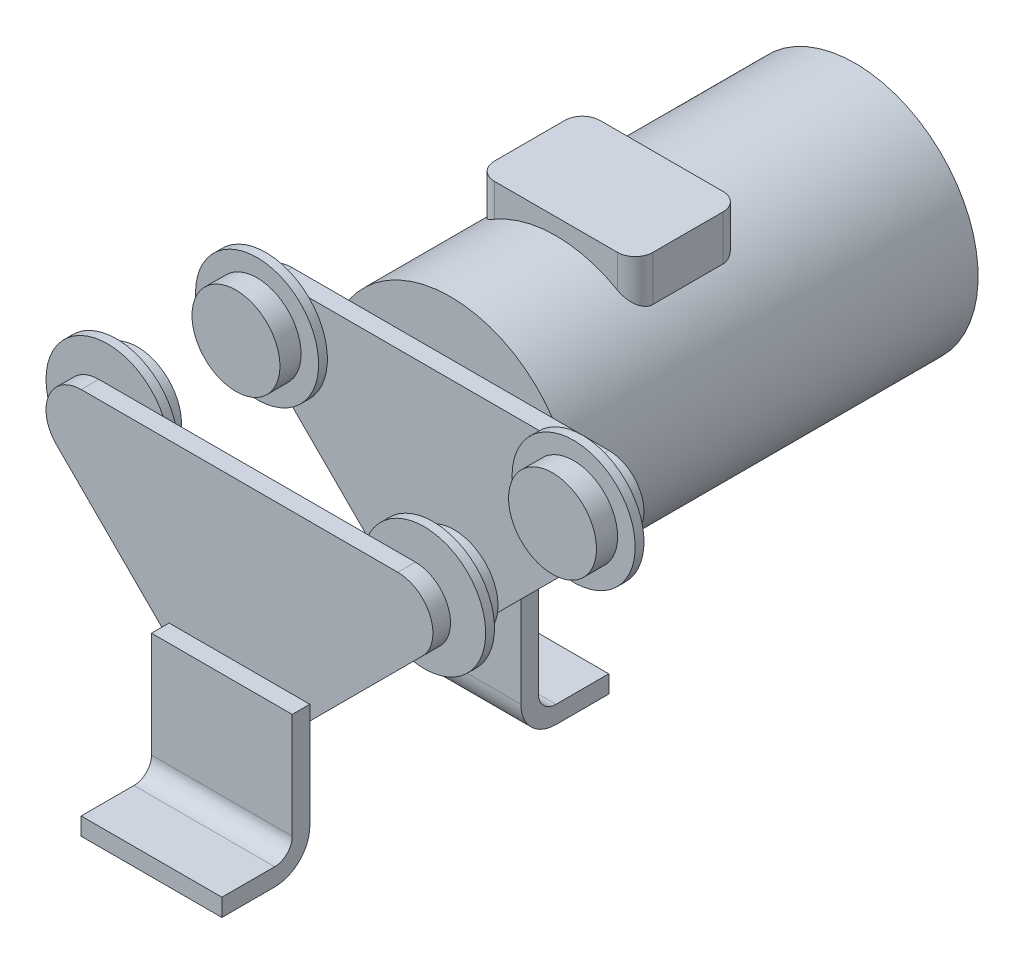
ISO-10303-21;
HEADER;
FILE_DESCRIPTION(('STEP AP214'),'2;1');
FILE_NAME('part.step','',(''),(''),'','','');
FILE_SCHEMA(('AUTOMOTIVE_DESIGN { 1 0 10303 214 1 1 1 1 }'));
ENDSEC;
DATA;
#1=APPLICATION_CONTEXT('core data for automotive mechanical design processes');
#2=APPLICATION_PROTOCOL_DEFINITION('international standard','automotive_design',2000,#1);
#3=PRODUCT_CONTEXT('',#1,'mechanical');
#4=PRODUCT('Part','Part','',(#3));
#5=PRODUCT_RELATED_PRODUCT_CATEGORY('part','',(#4));
#6=PRODUCT_DEFINITION_FORMATION('','',#4);
#7=PRODUCT_DEFINITION_CONTEXT('part definition',#1,'design');
#8=PRODUCT_DEFINITION('design','',#6,#7);
#9=PRODUCT_DEFINITION_SHAPE('','',#8);
#10=(LENGTH_UNIT() NAMED_UNIT(*) SI_UNIT(.MILLI.,.METRE.));
#11=(NAMED_UNIT(*) PLANE_ANGLE_UNIT() SI_UNIT($,.RADIAN.));
#12=(NAMED_UNIT(*) SI_UNIT($,.STERADIAN.) SOLID_ANGLE_UNIT());
#13=UNCERTAINTY_MEASURE_WITH_UNIT(LENGTH_MEASURE(1.E-05),#10,'distance_accuracy_value','');
#14=(GEOMETRIC_REPRESENTATION_CONTEXT(3) GLOBAL_UNCERTAINTY_ASSIGNED_CONTEXT((#13)) GLOBAL_UNIT_ASSIGNED_CONTEXT((#10,
#11,#12)) REPRESENTATION_CONTEXT('',''));
#15=CARTESIAN_POINT('',(0.,0.,0.));
#16=DIRECTION('',(0.,0.,1.));
#17=DIRECTION('',(1.,0.,0.));
#18=AXIS2_PLACEMENT_3D('',#15,#16,#17);
#19=CARTESIAN_POINT('',(0.,-39.2893218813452,-340.));
#20=DIRECTION('',(0.,0.,1.));
#21=DIRECTION('',(1.,0.,0.));
#22=AXIS2_PLACEMENT_3D('',#19,#20,#21);
#23=CYLINDRICAL_SURFACE('',#22,70.);
#24=CARTESIAN_POINT('',(0.,-39.2893218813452,-120.));
#25=DIRECTION('',(0.,0.,-1.));
#26=DIRECTION('',(-1.,0.,0.));
#27=AXIS2_PLACEMENT_3D('',#24,#25,#26);
#28=CIRCLE('',#27,70.);
#29=CARTESIAN_POINT('',(40.,-96.7349483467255,-120.));
#30=VERTEX_POINT('',#29);
#31=CARTESIAN_POINT('',(-40.,-96.7349483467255,-120.));
#32=VERTEX_POINT('',#31);
#33=EDGE_CURVE('E408',#30,#32,#28,.T.);
#34=ORIENTED_EDGE('',*,*,#33,.T.);
#35=DIRECTION('',(0.,0.,1.));
#36=VECTOR('',#35,1.);
#37=CARTESIAN_POINT('',(-40.,-96.7349483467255,-340.));
#38=LINE('',#37,#36);
#39=CARTESIAN_POINT('',(-40.,-96.7349483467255,-110.));
#40=VERTEX_POINT('',#39);
#41=EDGE_CURVE('E414',#32,#40,#38,.T.);
#42=ORIENTED_EDGE('',*,*,#41,.T.);
#43=CARTESIAN_POINT('',(0.,-39.2893218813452,-110.));
#44=DIRECTION('',(0.,0.,-1.));
#45=DIRECTION('',(-1.,0.,0.));
#46=AXIS2_PLACEMENT_3D('',#43,#44,#45);
#47=CIRCLE('',#46,70.);
#48=CARTESIAN_POINT('',(-49.4974746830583,-88.7867965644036,-110.));
#49=VERTEX_POINT('',#48);
#50=EDGE_CURVE('E1290',#40,#49,#47,.T.);
#51=ORIENTED_EDGE('',*,*,#50,.T.);
#52=CARTESIAN_POINT('',(-57.9340071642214,0.,-110.));
#53=VERTEX_POINT('',#52);
#54=EDGE_CURVE('E1286',#49,#53,#47,.T.);
#55=ORIENTED_EDGE('',*,*,#54,.T.);
#56=CARTESIAN_POINT('',(57.9340071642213,0.,-110.));
#57=VERTEX_POINT('',#56);
#58=EDGE_CURVE('E1292',#53,#57,#47,.T.);
#59=ORIENTED_EDGE('',*,*,#58,.T.);
#60=CARTESIAN_POINT('',(49.4974746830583,-88.7867965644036,-110.));
#61=VERTEX_POINT('',#60);
#62=EDGE_CURVE('E1297',#57,#61,#47,.T.);
#63=ORIENTED_EDGE('',*,*,#62,.T.);
#64=CARTESIAN_POINT('',(40.,-96.7349483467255,-110.));
#65=VERTEX_POINT('',#64);
#66=EDGE_CURVE('E1293',#61,#65,#47,.T.);
#67=ORIENTED_EDGE('',*,*,#66,.T.);
#68=DIRECTION('',(0.,0.,1.));
#69=VECTOR('',#68,1.);
#70=CARTESIAN_POINT('',(40.,-96.7349483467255,-340.));
#71=LINE('',#70,#69);
#72=EDGE_CURVE('E411',#65,#30,#71,.F.);
#73=ORIENTED_EDGE('',*,*,#72,.T.);
#74=EDGE_LOOP('',(#34,#42,#51,#55,#59,#63,#67,#73));
#75=FACE_BOUND('',#74,.T.);
#76=CARTESIAN_POINT('',(0.,-39.2893218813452,-340.));
#77=DIRECTION('',(0.,0.,-1.));
#78=DIRECTION('',(-1.,0.,0.));
#79=AXIS2_PLACEMENT_3D('',#76,#77,#78);
#80=CIRCLE('',#79,70.);
#81=CARTESIAN_POINT('',(-70.,-39.2893218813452,-340.));
#82=VERTEX_POINT('',#81);
#83=EDGE_CURVE('E577',#82,#82,#80,.T.);
#84=ORIENTED_EDGE('',*,*,#83,.F.);
#85=EDGE_LOOP('',(#84));
#86=FACE_BOUND('',#85,.T.);
#87=CARTESIAN_POINT('',(35.,21.3324563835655,-230.));
#88=CARTESIAN_POINT('',(34.7036925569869,21.5035294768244,-229.999999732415));
#89=CARTESIAN_POINT('',(34.4061203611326,21.6724304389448,-229.986829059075));
#90=CARTESIAN_POINT('',(33.8104805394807,22.004786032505,-229.933499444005));
#91=CARTESIAN_POINT('',(33.5124131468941,22.168242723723,-229.893350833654));
#92=CARTESIAN_POINT('',(32.9176711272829,22.4888384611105,-229.785462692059));
#93=CARTESIAN_POINT('',(32.6209971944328,22.6459746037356,-229.717710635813));
#94=CARTESIAN_POINT('',(32.0316875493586,22.9527964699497,-229.554191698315));
#95=CARTESIAN_POINT('',(31.7390501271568,23.1024854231,-229.458437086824));
#96=CARTESIAN_POINT('',(31.1586612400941,23.3943596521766,-229.238019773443));
#97=CARTESIAN_POINT('',(30.8709466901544,23.5364977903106,-229.113196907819));
#98=CARTESIAN_POINT('',(30.3049955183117,23.8114406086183,-228.834950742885));
#99=CARTESIAN_POINT('',(30.0267591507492,23.94424503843,-228.681526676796));
#100=CARTESIAN_POINT('',(29.4829713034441,24.1996111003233,-228.346516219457));
#101=CARTESIAN_POINT('',(29.217414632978,24.3221769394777,-228.164941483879));
#102=CARTESIAN_POINT('',(28.7020986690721,24.556348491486,-227.774375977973));
#103=CARTESIAN_POINT('',(28.4523373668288,24.6679555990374,-227.565388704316));
#104=CARTESIAN_POINT('',(27.9964027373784,24.8687410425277,-227.14394387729));
#105=CARTESIAN_POINT('',(27.788382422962,24.9590459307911,-226.934017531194));
#106=CARTESIAN_POINT('',(27.3900355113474,25.1298749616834,-226.494336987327));
#107=CARTESIAN_POINT('',(27.1997071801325,25.2104000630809,-226.264584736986));
#108=CARTESIAN_POINT('',(26.839060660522,25.3613010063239,-225.78693251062));
#109=CARTESIAN_POINT('',(26.6687334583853,25.4316814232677,-225.539040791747));
#110=CARTESIAN_POINT('',(26.3500869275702,25.5620664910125,-225.026920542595));
#111=CARTESIAN_POINT('',(26.2017659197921,25.6220719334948,-224.762693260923));
#112=CARTESIAN_POINT('',(25.9416367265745,25.726439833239,-224.245231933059));
#113=CARTESIAN_POINT('',(25.827719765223,25.7717360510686,-223.993243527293));
#114=CARTESIAN_POINT('',(25.6207672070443,25.8535110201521,-223.47946444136));
#115=CARTESIAN_POINT('',(25.5277296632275,25.8899905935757,-223.217674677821));
#116=CARTESIAN_POINT('',(25.3635607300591,25.9540498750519,-222.686325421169));
#117=CARTESIAN_POINT('',(25.2924238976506,25.9816317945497,-222.416767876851));
#118=CARTESIAN_POINT('',(25.1728077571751,26.0278571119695,-221.871917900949));
#119=CARTESIAN_POINT('',(25.1243279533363,26.0465007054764,-221.596625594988));
#120=CARTESIAN_POINT('',(25.0523421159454,26.0741355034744,-221.055877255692));
#121=CARTESIAN_POINT('',(25.0277439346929,26.0835490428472,-220.790587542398));
#122=CARTESIAN_POINT('',(24.9998019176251,26.0942397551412,-220.25873381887));
#123=CARTESIAN_POINT('',(24.9964572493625,26.0955172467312,-219.992169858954));
#124=CARTESIAN_POINT('',(25.0110541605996,26.0899349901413,-219.459742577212));
#125=CARTESIAN_POINT('',(25.0289933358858,26.0830761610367,-219.19387917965));
#126=CARTESIAN_POINT('',(25.0859727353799,26.0612320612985,-218.664760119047));
#127=CARTESIAN_POINT('',(25.1250129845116,26.0462467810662,-218.401504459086));
#128=CARTESIAN_POINT('',(25.2231487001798,26.00842303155,-217.882952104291));
#129=CARTESIAN_POINT('',(25.2819728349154,25.985690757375,-217.627596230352));
#130=CARTESIAN_POINT('',(25.419211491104,25.9323700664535,-217.123050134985));
#131=CARTESIAN_POINT('',(25.4976257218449,25.9017817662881,-216.873859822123));
#132=CARTESIAN_POINT('',(25.6732874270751,25.8328034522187,-216.383330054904));
#133=CARTESIAN_POINT('',(25.7705345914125,25.7944135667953,-216.141990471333));
#134=CARTESIAN_POINT('',(25.9829388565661,25.7099084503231,-215.668731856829));
#135=CARTESIAN_POINT('',(26.098096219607,25.6637931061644,-215.436812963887));
#136=CARTESIAN_POINT('',(26.3471009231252,25.563192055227,-214.980446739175));
#137=CARTESIAN_POINT('',(26.4812027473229,25.5085911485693,-214.756163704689));
#138=CARTESIAN_POINT('',(26.765489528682,25.3916813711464,-214.320161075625));
#139=CARTESIAN_POINT('',(26.9156745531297,25.3293724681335,-214.108441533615));
#140=CARTESIAN_POINT('',(27.2307665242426,25.1972234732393,-213.698746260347));
#141=CARTESIAN_POINT('',(27.3956742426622,25.1273829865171,-213.500771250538));
#142=CARTESIAN_POINT('',(27.7387639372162,24.9803894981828,-213.119577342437));
#143=CARTESIAN_POINT('',(27.9169469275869,24.903235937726,-212.936359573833));
#144=CARTESIAN_POINT('',(28.2934139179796,24.7382256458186,-212.577578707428));
#145=CARTESIAN_POINT('',(28.4922426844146,24.6500425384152,-212.402737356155));
#146=CARTESIAN_POINT('',(28.9010143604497,24.4663176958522,-212.070832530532));
#147=CARTESIAN_POINT('',(29.1109575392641,24.3707757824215,-211.9137694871));
#148=CARTESIAN_POINT('',(29.5402629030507,24.1727041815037,-211.617921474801));
#149=CARTESIAN_POINT('',(29.7596266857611,24.0701733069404,-211.479139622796));
#150=CARTESIAN_POINT('',(30.2060593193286,23.8585601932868,-211.220208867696));
#151=CARTESIAN_POINT('',(30.4331287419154,23.7494774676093,-211.100061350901));
#152=CARTESIAN_POINT('',(30.9117471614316,23.5162533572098,-210.869707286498));
#153=CARTESIAN_POINT('',(31.1638018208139,23.3916053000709,-210.761063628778));
#154=CARTESIAN_POINT('',(31.6730559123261,23.1358231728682,-210.565709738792));
#155=CARTESIAN_POINT('',(31.9302555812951,23.0046888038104,-210.479000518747));
#156=CARTESIAN_POINT('',(32.4480343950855,22.7365603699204,-210.327344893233));
#157=CARTESIAN_POINT('',(32.7086140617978,22.5995653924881,-210.262401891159));
#158=CARTESIAN_POINT('',(33.2315386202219,22.3203587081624,-210.153991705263));
#159=CARTESIAN_POINT('',(33.4938841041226,22.1781451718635,-210.110532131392));
#160=CARTESIAN_POINT('',(34.0474023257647,21.8734507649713,-210.041154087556));
#161=CARTESIAN_POINT('',(34.3385961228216,21.7104519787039,-210.017667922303));
#162=CARTESIAN_POINT('',(34.91943193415,21.3798220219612,-209.996099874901));
#163=CARTESIAN_POINT('',(35.2090731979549,21.2121888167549,-209.998029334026));
#164=CARTESIAN_POINT('',(35.7850254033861,20.873321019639,-210.026691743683));
#165=CARTESIAN_POINT('',(36.0713360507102,20.7020861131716,-210.053426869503));
#166=CARTESIAN_POINT('',(36.639086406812,20.3570336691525,-210.131083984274));
#167=CARTESIAN_POINT('',(36.9205257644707,20.1832159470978,-210.182007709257));
#168=CARTESIAN_POINT('',(37.5074514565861,19.8150245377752,-210.31430077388));
#169=CARTESIAN_POINT('',(37.8122184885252,19.6204738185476,-210.39838191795));
#170=CARTESIAN_POINT('',(38.4122775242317,19.2309731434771,-210.59489165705));
#171=CARTESIAN_POINT('',(38.7075678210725,19.0360231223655,-210.707325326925));
#172=CARTESIAN_POINT('',(39.2873038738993,18.6471066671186,-210.960134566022));
#173=CARTESIAN_POINT('',(39.5717338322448,18.4531419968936,-211.100549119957));
#174=CARTESIAN_POINT('',(40.1274312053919,18.0683579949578,-211.408704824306));
#175=CARTESIAN_POINT('',(40.3987039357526,17.8775374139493,-211.576434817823));
#176=CARTESIAN_POINT('',(40.9370720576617,17.493332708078,-211.946297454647));
#177=CARTESIAN_POINT('',(41.2035506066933,17.3001590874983,-212.149550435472));
#178=CARTESIAN_POINT('',(41.7180847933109,16.9219169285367,-212.585085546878));
#179=CARTESIAN_POINT('',(41.9661369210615,16.7368499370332,-212.817373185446));
#180=CARTESIAN_POINT('',(42.4405576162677,16.3783285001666,-213.310094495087));
#181=CARTESIAN_POINT('',(42.6669705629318,16.2048505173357,-213.570468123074));
#182=CARTESIAN_POINT('',(43.0954601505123,15.8727548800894,-214.119138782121));
#183=CARTESIAN_POINT('',(43.2975512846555,15.7141283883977,-214.407418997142));
#184=CARTESIAN_POINT('',(43.6082956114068,15.4677884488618,-214.905785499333));
#185=CARTESIAN_POINT('',(43.7250008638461,15.3745994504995,-215.108196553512));
#186=CARTESIAN_POINT('',(43.9453765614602,15.1975924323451,-215.523892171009));
#187=CARTESIAN_POINT('',(44.0490507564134,15.1137717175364,-215.737173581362));
#188=CARTESIAN_POINT('',(44.2421174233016,14.9568809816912,-216.17374942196));
#189=CARTESIAN_POINT('',(44.3315194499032,14.8838037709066,-216.397037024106));
#190=CARTESIAN_POINT('',(44.4949070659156,14.7496865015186,-216.852728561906));
#191=CARTESIAN_POINT('',(44.5688920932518,14.6886468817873,-217.085132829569));
#192=CARTESIAN_POINT('',(44.7008040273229,14.5794587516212,-217.559606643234));
#193=CARTESIAN_POINT('',(44.7585936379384,14.5314205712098,-217.801740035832));
#194=CARTESIAN_POINT('',(44.85623535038,14.4500696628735,-218.292049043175));
#195=CARTESIAN_POINT('',(44.8960875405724,14.4167568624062,-218.540224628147));
#196=CARTESIAN_POINT('',(44.9570298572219,14.3657529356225,-219.040327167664));
#197=CARTESIAN_POINT('',(44.9781305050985,14.3480530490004,-219.292251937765));
#198=CARTESIAN_POINT('',(45.0011485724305,14.328742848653,-219.797579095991));
#199=CARTESIAN_POINT('',(45.0030682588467,14.327130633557,-220.050981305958));
#200=CARTESIAN_POINT('',(44.9886580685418,14.3392217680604,-220.525102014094));
#201=CARTESIAN_POINT('',(44.9745814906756,14.3510341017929,-220.745942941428));
#202=CARTESIAN_POINT('',(44.9319633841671,14.3867383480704,-221.185240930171));
#203=CARTESIAN_POINT('',(44.903421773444,14.4106303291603,-221.403697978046));
#204=CARTESIAN_POINT('',(44.8323277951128,14.4699984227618,-221.836701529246));
#205=CARTESIAN_POINT('',(44.7897758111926,14.5054742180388,-222.051248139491));
#206=CARTESIAN_POINT('',(44.6912917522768,14.5873199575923,-222.475119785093));
#207=CARTESIAN_POINT('',(44.6353590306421,14.6336904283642,-222.684444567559));
#208=CARTESIAN_POINT('',(44.5104910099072,14.7368085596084,-223.097979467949));
#209=CARTESIAN_POINT('',(44.4414807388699,14.7936159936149,-223.302151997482));
#210=CARTESIAN_POINT('',(44.2915149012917,14.916499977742,-223.703194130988));
#211=CARTESIAN_POINT('',(44.2105558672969,14.9825792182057,-223.900061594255));
#212=CARTESIAN_POINT('',(43.9509556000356,15.1933639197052,-224.478717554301));
#213=CARTESIAN_POINT('',(43.7555632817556,15.3506396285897,-224.848650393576));
#214=CARTESIAN_POINT('',(43.3883269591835,15.6423754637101,-225.451866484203));
#215=CARTESIAN_POINT('',(43.2256728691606,15.7705401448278,-225.694021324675));
#216=CARTESIAN_POINT('',(42.8831531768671,16.0377268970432,-226.159489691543));
#217=CARTESIAN_POINT('',(42.7032867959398,16.1767494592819,-226.382802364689));
#218=CARTESIAN_POINT('',(42.3279830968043,16.4636840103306,-226.810412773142));
#219=CARTESIAN_POINT('',(42.1325239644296,16.6116083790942,-227.014682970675));
#220=CARTESIAN_POINT('',(41.7279919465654,16.9142253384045,-227.403572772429));
#221=CARTESIAN_POINT('',(41.5189201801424,17.0689173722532,-227.588193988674));
#222=CARTESIAN_POINT('',(40.8676774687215,17.5448487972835,-228.116989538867));
#223=CARTESIAN_POINT('',(40.4061866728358,17.8743138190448,-228.430793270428));
#224=CARTESIAN_POINT('',(39.6847606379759,18.3752801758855,-228.839089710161));
#225=CARTESIAN_POINT('',(39.439380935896,18.5434230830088,-228.964801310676));
#226=CARTESIAN_POINT('',(38.9397536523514,18.8809988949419,-229.195322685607));
#227=CARTESIAN_POINT('',(38.6855065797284,19.0504317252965,-229.300133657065));
#228=CARTESIAN_POINT('',(38.1551625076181,19.3987497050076,-229.493628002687));
#229=CARTESIAN_POINT('',(37.878632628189,19.5776425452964,-229.581108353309));
#230=CARTESIAN_POINT('',(37.3183943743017,19.9343870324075,-229.731864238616));
#231=CARTESIAN_POINT('',(37.0346861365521,20.1122386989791,-229.795140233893));
#232=CARTESIAN_POINT('',(36.4614741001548,20.4657977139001,-229.896910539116));
#233=CARTESIAN_POINT('',(36.1719693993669,20.6415047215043,-229.935400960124));
#234=CARTESIAN_POINT('',(35.5887278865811,20.989677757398,-229.986946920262));
#235=CARTESIAN_POINT('',(35.2949907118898,21.1621435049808,-230.000000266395));
#236=CARTESIAN_POINT('',(35.,21.3324563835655,-230.));
#237=B_SPLINE_CURVE_WITH_KNOTS('',3,(#87,#88,#89,#90,#91,#92,#93,#94,#95,#96,#97,#98,#99,#100,
#101,#102,#103,#104,#105,#106,#107,#108,#109,#110,#111,#112,#113,#114,#115,#116,#117,#118,#119,
#120,#121,#122,#123,#124,#125,#126,#127,#128,#129,#130,#131,#132,#133,#134,#135,#136,#137,#138,
#139,#140,#141,#142,#143,#144,#145,#146,#147,#148,#149,#150,#151,#152,#153,#154,#155,#156,#157,
#158,#159,#160,#161,#162,#163,#164,#165,#166,#167,#168,#169,#170,#171,#172,#173,#174,#175,#176,
#177,#178,#179,#180,#181,#182,#183,#184,#185,#186,#187,#188,#189,#190,#191,#192,#193,#194,#195,
#196,#197,#198,#199,#200,#201,#202,#203,#204,#205,#206,#207,#208,#209,#210,#211,#212,#213,#214,
#215,#216,#217,#218,#219,#220,#221,#222,#223,#224,#225,#226,#227,#228,#229,#230,#231,#232,#233,
#234,#235,#236),.UNSPECIFIED.,.T.,.F.,(4,2,2,2,2,2,2,2,2,2,2,2,2,2,2,2,2,2,2,2,2,2,2,2,2,2,2,2,
2,2,2,2,2,2,2,2,2,2,2,2,2,2,2,2,2,2,2,2,2,2,2,2,2,2,2,2,2,2,2,2,2,2,2,2,2,2,2,2,2,2,2,2,2,2,4),
(0.,1.02617685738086,2.05196095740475,3.07821102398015,4.10401209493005,5.13560487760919,
6.16722532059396,7.19841976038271,8.22948279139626,9.15531177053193,10.0810499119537,
11.0063692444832,11.9316179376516,12.7712391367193,13.6107820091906,14.450116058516,
15.289431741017,16.0882493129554,16.8870355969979,17.6857316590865,18.4844286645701,
19.2725904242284,20.0607404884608,20.8488775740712,21.6370261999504,22.4369993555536,
23.2369758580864,24.0369943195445,24.8370739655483,25.6733645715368,26.5096754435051,
27.346128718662,28.1826441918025,29.0860426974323,29.9894828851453,30.8930642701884,
31.7969654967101,32.7995251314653,33.8025321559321,34.8056271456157,35.8087941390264,
36.9212159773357,38.0338370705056,39.1480193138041,40.2617476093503,41.4206969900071,
42.579866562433,43.7366053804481,44.8926514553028,45.6466312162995,46.4003935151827,
47.1536490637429,47.9069320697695,48.666420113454,49.4259044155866,50.1849623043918,
50.9439304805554,51.6079380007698,52.2719492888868,52.9359423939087,53.5999675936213,
54.2679215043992,54.9360696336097,56.2720753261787,57.2268566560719,58.1816811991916,
59.1378657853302,60.0939718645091,62.0298459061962,62.9980763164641,63.9662512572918,
64.9876391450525,66.0090075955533,67.0305362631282,68.0521529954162),.UNSPECIFIED.);
#238=CARTESIAN_POINT('',(45.,14.3297045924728,-220.));
#239=VERTEX_POINT('',#238);
#240=CARTESIAN_POINT('',(35.,21.3324563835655,-230.));
#241=VERTEX_POINT('',#240);
#242=EDGE_CURVE('E11',#239,#241,#237,.T.);
#243=ORIENTED_EDGE('',*,*,#242,.F.);
#244=DIRECTION('',(0.,0.,1.));
#245=VECTOR('',#244,1.);
#246=CARTESIAN_POINT('',(45.,14.3297045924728,-340.));
#247=LINE('',#246,#245);
#248=CARTESIAN_POINT('',(45.,14.3297045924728,-180.));
#249=VERTEX_POINT('',#248);
#250=EDGE_CURVE('E435',#249,#239,#247,.F.);
#251=ORIENTED_EDGE('',*,*,#250,.F.);
#252=CARTESIAN_POINT('',(35.,21.3324563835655,-190.));
#253=CARTESIAN_POINT('',(34.7036925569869,21.5035294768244,-189.999999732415));
#254=CARTESIAN_POINT('',(34.4061203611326,21.6724304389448,-189.986829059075));
#255=CARTESIAN_POINT('',(33.8104805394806,22.004786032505,-189.933499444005));
#256=CARTESIAN_POINT('',(33.5124131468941,22.168242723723,-189.893350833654));
#257=CARTESIAN_POINT('',(32.9176711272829,22.4888384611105,-189.785462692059));
#258=CARTESIAN_POINT('',(32.6209971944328,22.6459746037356,-189.717710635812));
#259=CARTESIAN_POINT('',(32.0316875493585,22.9527964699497,-189.554191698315));
#260=CARTESIAN_POINT('',(31.7390501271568,23.1024854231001,-189.458437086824));
#261=CARTESIAN_POINT('',(31.1586612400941,23.3943596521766,-189.238019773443));
#262=CARTESIAN_POINT('',(30.8709466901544,23.5364977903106,-189.113196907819));
#263=CARTESIAN_POINT('',(30.3049955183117,23.8114406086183,-188.834950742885));
#264=CARTESIAN_POINT('',(30.0267591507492,23.94424503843,-188.681526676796));
#265=CARTESIAN_POINT('',(29.4829713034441,24.1996111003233,-188.346516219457));
#266=CARTESIAN_POINT('',(29.217414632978,24.3221769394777,-188.164941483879));
#267=CARTESIAN_POINT('',(28.7020986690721,24.556348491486,-187.774375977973));
#268=CARTESIAN_POINT('',(28.4523373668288,24.6679555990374,-187.565388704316));
#269=CARTESIAN_POINT('',(27.9964027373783,24.8687410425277,-187.14394387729));
#270=CARTESIAN_POINT('',(27.788382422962,24.9590459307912,-186.934017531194));
#271=CARTESIAN_POINT('',(27.3900355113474,25.1298749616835,-186.494336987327));
#272=CARTESIAN_POINT('',(27.1997071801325,25.2104000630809,-186.264584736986));
#273=CARTESIAN_POINT('',(26.839060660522,25.3613010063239,-185.78693251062));
#274=CARTESIAN_POINT('',(26.6687334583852,25.4316814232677,-185.539040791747));
#275=CARTESIAN_POINT('',(26.3500869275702,25.5620664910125,-185.026920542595));
#276=CARTESIAN_POINT('',(26.201765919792,25.6220719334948,-184.762693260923));
#277=CARTESIAN_POINT('',(25.9416367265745,25.726439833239,-184.245231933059));
#278=CARTESIAN_POINT('',(25.8277197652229,25.7717360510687,-183.993243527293));
#279=CARTESIAN_POINT('',(25.6207672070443,25.8535110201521,-183.47946444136));
#280=CARTESIAN_POINT('',(25.5277296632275,25.8899905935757,-183.217674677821));
#281=CARTESIAN_POINT('',(25.363560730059,25.9540498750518,-182.686325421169));
#282=CARTESIAN_POINT('',(25.2924238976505,25.9816317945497,-182.416767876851));
#283=CARTESIAN_POINT('',(25.1728077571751,26.0278571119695,-181.871917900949));
#284=CARTESIAN_POINT('',(25.1243279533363,26.0465007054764,-181.596625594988));
#285=CARTESIAN_POINT('',(25.0523421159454,26.0741355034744,-181.055877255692));
#286=CARTESIAN_POINT('',(25.0277439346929,26.0835490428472,-180.790587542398));
#287=CARTESIAN_POINT('',(24.9998019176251,26.0942397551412,-180.25873381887));
#288=CARTESIAN_POINT('',(24.9964572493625,26.0955172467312,-179.992169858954));
#289=CARTESIAN_POINT('',(25.0110541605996,26.0899349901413,-179.459742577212));
#290=CARTESIAN_POINT('',(25.0289933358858,26.0830761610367,-179.19387917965));
#291=CARTESIAN_POINT('',(25.0859727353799,26.0612320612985,-178.664760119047));
#292=CARTESIAN_POINT('',(25.1250129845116,26.0462467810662,-178.401504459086));
#293=CARTESIAN_POINT('',(25.2231487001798,26.00842303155,-177.882952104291));
#294=CARTESIAN_POINT('',(25.2819728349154,25.985690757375,-177.627596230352));
#295=CARTESIAN_POINT('',(25.419211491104,25.9323700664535,-177.123050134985));
#296=CARTESIAN_POINT('',(25.4976257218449,25.9017817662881,-176.873859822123));
#297=CARTESIAN_POINT('',(25.6732874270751,25.8328034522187,-176.383330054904));
#298=CARTESIAN_POINT('',(25.7705345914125,25.7944135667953,-176.141990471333));
#299=CARTESIAN_POINT('',(25.9829388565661,25.709908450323,-175.668731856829));
#300=CARTESIAN_POINT('',(26.098096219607,25.6637931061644,-175.436812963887));
#301=CARTESIAN_POINT('',(26.3471009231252,25.563192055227,-174.980446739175));
#302=CARTESIAN_POINT('',(26.4812027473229,25.5085911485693,-174.756163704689));
#303=CARTESIAN_POINT('',(26.765489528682,25.3916813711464,-174.320161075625));
#304=CARTESIAN_POINT('',(26.9156745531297,25.3293724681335,-174.108441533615));
#305=CARTESIAN_POINT('',(27.2307665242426,25.1972234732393,-173.698746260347));
#306=CARTESIAN_POINT('',(27.3956742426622,25.1273829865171,-173.500771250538));
#307=CARTESIAN_POINT('',(27.7387639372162,24.9803894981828,-173.119577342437));
#308=CARTESIAN_POINT('',(27.916946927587,24.903235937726,-172.936359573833));
#309=CARTESIAN_POINT('',(28.2934139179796,24.7382256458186,-172.577578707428));
#310=CARTESIAN_POINT('',(28.4922426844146,24.6500425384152,-172.402737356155));
#311=CARTESIAN_POINT('',(28.9010143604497,24.4663176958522,-172.070832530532));
#312=CARTESIAN_POINT('',(29.1109575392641,24.3707757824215,-171.9137694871));
#313=CARTESIAN_POINT('',(29.5402629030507,24.1727041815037,-171.617921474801));
#314=CARTESIAN_POINT('',(29.7596266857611,24.0701733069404,-171.479139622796));
#315=CARTESIAN_POINT('',(30.2060593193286,23.8585601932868,-171.220208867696));
#316=CARTESIAN_POINT('',(30.4331287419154,23.7494774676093,-171.100061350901));
#317=CARTESIAN_POINT('',(30.9117471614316,23.5162533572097,-170.869707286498));
#318=CARTESIAN_POINT('',(31.1638018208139,23.3916053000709,-170.761063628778));
#319=CARTESIAN_POINT('',(31.6730559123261,23.1358231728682,-170.565709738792));
#320=CARTESIAN_POINT('',(31.9302555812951,23.0046888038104,-170.479000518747));
#321=CARTESIAN_POINT('',(32.4480343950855,22.7365603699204,-170.327344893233));
#322=CARTESIAN_POINT('',(32.7086140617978,22.5995653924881,-170.262401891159));
#323=CARTESIAN_POINT('',(33.2315386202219,22.3203587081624,-170.153991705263));
#324=CARTESIAN_POINT('',(33.4938841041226,22.1781451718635,-170.110532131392));
#325=CARTESIAN_POINT('',(34.0474023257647,21.8734507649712,-170.041154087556));
#326=CARTESIAN_POINT('',(34.3385961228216,21.7104519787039,-170.017667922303));
#327=CARTESIAN_POINT('',(34.91943193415,21.3798220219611,-169.996099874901));
#328=CARTESIAN_POINT('',(35.2090731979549,21.2121888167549,-169.998029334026));
#329=CARTESIAN_POINT('',(35.7850254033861,20.873321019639,-170.026691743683));
#330=CARTESIAN_POINT('',(36.0713360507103,20.7020861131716,-170.053426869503));
#331=CARTESIAN_POINT('',(36.639086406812,20.3570336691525,-170.131083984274));
#332=CARTESIAN_POINT('',(36.9205257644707,20.1832159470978,-170.182007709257));
#333=CARTESIAN_POINT('',(37.5074514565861,19.8150245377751,-170.31430077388));
#334=CARTESIAN_POINT('',(37.8122184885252,19.6204738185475,-170.398381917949));
#335=CARTESIAN_POINT('',(38.4122775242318,19.2309731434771,-170.59489165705));
#336=CARTESIAN_POINT('',(38.7075678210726,19.0360231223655,-170.707325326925));
#337=CARTESIAN_POINT('',(39.2873038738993,18.6471066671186,-170.960134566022));
#338=CARTESIAN_POINT('',(39.5717338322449,18.4531419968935,-171.100549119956));
#339=CARTESIAN_POINT('',(40.127431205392,18.0683579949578,-171.408704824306));
#340=CARTESIAN_POINT('',(40.3987039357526,17.8775374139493,-171.576434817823));
#341=CARTESIAN_POINT('',(40.9370720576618,17.493332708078,-171.946297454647));
#342=CARTESIAN_POINT('',(41.2035506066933,17.3001590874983,-172.149550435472));
#343=CARTESIAN_POINT('',(41.7180847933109,16.9219169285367,-172.585085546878));
#344=CARTESIAN_POINT('',(41.9661369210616,16.7368499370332,-172.817373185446));
#345=CARTESIAN_POINT('',(42.4405576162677,16.3783285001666,-173.310094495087));
#346=CARTESIAN_POINT('',(42.6669705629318,16.2048505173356,-173.570468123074));
#347=CARTESIAN_POINT('',(43.0954601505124,15.8727548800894,-174.119138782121));
#348=CARTESIAN_POINT('',(43.2975512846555,15.7141283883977,-174.407418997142));
#349=CARTESIAN_POINT('',(43.6082956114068,15.4677884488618,-174.905785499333));
#350=CARTESIAN_POINT('',(43.7250008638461,15.3745994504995,-175.108196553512));
#351=CARTESIAN_POINT('',(43.9453765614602,15.1975924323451,-175.523892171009));
#352=CARTESIAN_POINT('',(44.0490507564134,15.1137717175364,-175.737173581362));
#353=CARTESIAN_POINT('',(44.2421174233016,14.9568809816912,-176.17374942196));
#354=CARTESIAN_POINT('',(44.3315194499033,14.8838037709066,-176.397037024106));
#355=CARTESIAN_POINT('',(44.4949070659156,14.7496865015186,-176.852728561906));
#356=CARTESIAN_POINT('',(44.5688920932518,14.6886468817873,-177.085132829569));
#357=CARTESIAN_POINT('',(44.7008040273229,14.5794587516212,-177.559606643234));
#358=CARTESIAN_POINT('',(44.7585936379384,14.5314205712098,-177.801740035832));
#359=CARTESIAN_POINT('',(44.85623535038,14.4500696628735,-178.292049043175));
#360=CARTESIAN_POINT('',(44.8960875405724,14.4167568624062,-178.540224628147));
#361=CARTESIAN_POINT('',(44.9570298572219,14.3657529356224,-179.040327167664));
#362=CARTESIAN_POINT('',(44.9781305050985,14.3480530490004,-179.292251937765));
#363=CARTESIAN_POINT('',(45.0011485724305,14.328742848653,-179.797579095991));
#364=CARTESIAN_POINT('',(45.0030682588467,14.327130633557,-180.050981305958));
#365=CARTESIAN_POINT('',(44.9886580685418,14.3392217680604,-180.525102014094));
#366=CARTESIAN_POINT('',(44.9745814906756,14.3510341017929,-180.745942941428));
#367=CARTESIAN_POINT('',(44.9319633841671,14.3867383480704,-181.185240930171));
#368=CARTESIAN_POINT('',(44.903421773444,14.4106303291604,-181.403697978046));
#369=CARTESIAN_POINT('',(44.8323277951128,14.4699984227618,-181.836701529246));
#370=CARTESIAN_POINT('',(44.7897758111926,14.5054742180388,-182.051248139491));
#371=CARTESIAN_POINT('',(44.6912917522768,14.5873199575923,-182.475119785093));
#372=CARTESIAN_POINT('',(44.635359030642,14.6336904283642,-182.684444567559));
#373=CARTESIAN_POINT('',(44.5104910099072,14.7368085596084,-183.097979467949));
#374=CARTESIAN_POINT('',(44.4414807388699,14.7936159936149,-183.302151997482));
#375=CARTESIAN_POINT('',(44.2915149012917,14.916499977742,-183.703194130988));
#376=CARTESIAN_POINT('',(44.2105558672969,14.9825792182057,-183.900061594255));
#377=CARTESIAN_POINT('',(43.9509556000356,15.1933639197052,-184.478717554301));
#378=CARTESIAN_POINT('',(43.7555632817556,15.3506396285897,-184.848650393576));
#379=CARTESIAN_POINT('',(43.3883269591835,15.6423754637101,-185.451866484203));
#380=CARTESIAN_POINT('',(43.2256728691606,15.7705401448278,-185.694021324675));
#381=CARTESIAN_POINT('',(42.8831531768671,16.0377268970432,-186.159489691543));
#382=CARTESIAN_POINT('',(42.7032867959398,16.1767494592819,-186.382802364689));
#383=CARTESIAN_POINT('',(42.3279830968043,16.4636840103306,-186.810412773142));
#384=CARTESIAN_POINT('',(42.1325239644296,16.6116083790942,-187.014682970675));
#385=CARTESIAN_POINT('',(41.7279919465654,16.9142253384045,-187.403572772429));
#386=CARTESIAN_POINT('',(41.5189201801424,17.0689173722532,-187.588193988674));
#387=CARTESIAN_POINT('',(40.8676774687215,17.5448487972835,-188.116989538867));
#388=CARTESIAN_POINT('',(40.4061866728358,17.8743138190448,-188.430793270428));
#389=CARTESIAN_POINT('',(39.6847606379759,18.3752801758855,-188.839089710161));
#390=CARTESIAN_POINT('',(39.439380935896,18.5434230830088,-188.964801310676));
#391=CARTESIAN_POINT('',(38.9397536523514,18.8809988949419,-189.195322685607));
#392=CARTESIAN_POINT('',(38.6855065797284,19.0504317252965,-189.300133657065));
#393=CARTESIAN_POINT('',(38.1551625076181,19.3987497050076,-189.493628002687));
#394=CARTESIAN_POINT('',(37.878632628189,19.5776425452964,-189.581108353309));
#395=CARTESIAN_POINT('',(37.3183943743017,19.9343870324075,-189.731864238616));
#396=CARTESIAN_POINT('',(37.0346861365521,20.1122386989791,-189.795140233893));
#397=CARTESIAN_POINT('',(36.4614741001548,20.4657977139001,-189.896910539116));
#398=CARTESIAN_POINT('',(36.1719693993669,20.6415047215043,-189.935400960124));
#399=CARTESIAN_POINT('',(35.5887278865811,20.989677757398,-189.986946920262));
#400=CARTESIAN_POINT('',(35.2949907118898,21.1621435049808,-190.000000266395));
#401=CARTESIAN_POINT('',(35.,21.3324563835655,-190.));
#402=B_SPLINE_CURVE_WITH_KNOTS('',3,(#252,#253,#254,#255,#256,#257,#258,#259,#260,#261,#262,
#263,#264,#265,#266,#267,#268,#269,#270,#271,#272,#273,#274,#275,#276,#277,#278,#279,#280,#281,
#282,#283,#284,#285,#286,#287,#288,#289,#290,#291,#292,#293,#294,#295,#296,#297,#298,#299,#300,
#301,#302,#303,#304,#305,#306,#307,#308,#309,#310,#311,#312,#313,#314,#315,#316,#317,#318,#319,
#320,#321,#322,#323,#324,#325,#326,#327,#328,#329,#330,#331,#332,#333,#334,#335,#336,#337,#338,
#339,#340,#341,#342,#343,#344,#345,#346,#347,#348,#349,#350,#351,#352,#353,#354,#355,#356,#357,
#358,#359,#360,#361,#362,#363,#364,#365,#366,#367,#368,#369,#370,#371,#372,#373,#374,#375,#376,
#377,#378,#379,#380,#381,#382,#383,#384,#385,#386,#387,#388,#389,#390,#391,#392,#393,#394,#395,
#396,#397,#398,#399,#400,#401),.UNSPECIFIED.,.T.,.F.,(4,2,2,2,2,2,2,2,2,2,2,2,2,2,2,2,2,2,2,2,2,
2,2,2,2,2,2,2,2,2,2,2,2,2,2,2,2,2,2,2,2,2,2,2,2,2,2,2,2,2,2,2,2,2,2,2,2,2,2,2,2,2,2,2,2,2,2,2,2,
2,2,2,2,2,4),(0.,1.02617685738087,2.05196095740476,3.07821102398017,4.10401209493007,
5.1356048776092,6.16722532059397,7.19841976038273,8.22948279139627,9.15531177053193,
10.0810499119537,11.0063692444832,11.9316179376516,12.7712391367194,13.6107820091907,
14.4501160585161,15.289431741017,16.0882493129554,16.8870355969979,17.6857316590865,
18.4844286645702,19.2725904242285,20.0607404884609,20.8488775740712,21.6370261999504,
22.4369993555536,23.2369758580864,24.0369943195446,24.8370739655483,25.6733645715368,
26.5096754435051,27.3461287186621,28.1826441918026,29.0860426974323,29.9894828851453,
30.8930642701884,31.7969654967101,32.7995251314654,33.8025321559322,34.8056271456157,
35.8087941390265,36.9212159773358,38.0338370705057,39.1480193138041,40.2617476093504,
41.4206969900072,42.5798665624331,43.7366053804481,44.8926514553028,45.6466312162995,
46.4003935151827,47.1536490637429,47.9069320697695,48.666420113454,49.4259044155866,
50.1849623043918,50.9439304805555,51.6079380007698,52.2719492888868,52.9359423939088,
53.5999675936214,54.2679215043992,54.9360696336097,56.2720753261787,57.2268566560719,
58.1816811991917,59.1378657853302,60.0939718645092,62.0298459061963,62.9980763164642,
63.9662512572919,64.9876391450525,66.0090075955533,67.0305362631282,68.0521529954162),.UNSPECIFIED.);
#403=CARTESIAN_POINT('',(35.,21.3324563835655,-170.));
#404=VERTEX_POINT('',#403);
#405=EDGE_CURVE('E438',#404,#249,#402,.T.);
#406=ORIENTED_EDGE('',*,*,#405,.F.);
#407=CARTESIAN_POINT('',(0.,-39.2893218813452,-170.));
#408=DIRECTION('',(0.,0.,-1.));
#409=DIRECTION('',(-1.,0.,0.));
#410=AXIS2_PLACEMENT_3D('',#407,#408,#409);
#411=CIRCLE('',#410,70.);
#412=CARTESIAN_POINT('',(-35.,21.3324563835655,-170.));
#413=VERTEX_POINT('',#412);
#414=EDGE_CURVE('E444',#413,#404,#411,.T.);
#415=ORIENTED_EDGE('',*,*,#414,.F.);
#416=CARTESIAN_POINT('',(-35.,21.3324563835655,-190.));
#417=CARTESIAN_POINT('',(-35.3692173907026,21.1192866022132,-189.999998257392));
#418=CARTESIAN_POINT('',(-35.7365467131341,20.9026982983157,-189.979545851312));
#419=CARTESIAN_POINT('',(-36.4640623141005,20.464779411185,-189.899018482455));
#420=CARTESIAN_POINT('',(-36.8242458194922,20.2434470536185,-189.838928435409));
#421=CARTESIAN_POINT('',(-37.5349527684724,19.7979310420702,-189.680225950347));
#422=CARTESIAN_POINT('',(-37.8854615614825,19.5737437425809,-189.581558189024));
#423=CARTESIAN_POINT('',(-38.573487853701,19.1251851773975,-189.346779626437));
#424=CARTESIAN_POINT('',(-38.9110079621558,18.9008139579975,-189.210676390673));
#425=CARTESIAN_POINT('',(-39.5365576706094,18.477349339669,-188.917755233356));
#426=CARTESIAN_POINT('',(-39.8261084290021,18.2780280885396,-188.764504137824));
#427=CARTESIAN_POINT('',(-40.390749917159,17.883276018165,-188.428977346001));
#428=CARTESIAN_POINT('',(-40.6658401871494,17.6878453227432,-188.246700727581));
#429=CARTESIAN_POINT('',(-41.1990161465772,17.3035126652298,-187.853770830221));
#430=CARTESIAN_POINT('',(-41.4571269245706,17.11460127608,-187.643160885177));
#431=CARTESIAN_POINT('',(-41.9543829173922,16.7457162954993,-187.193665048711));
#432=CARTESIAN_POINT('',(-42.1935341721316,16.5657398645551,-186.954788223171));
#433=CARTESIAN_POINT('',(-42.5911956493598,16.2627750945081,-186.514416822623));
#434=CARTESIAN_POINT('',(-42.7545909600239,16.1370649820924,-186.319181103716));
#435=CARTESIAN_POINT('',(-43.0681584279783,15.8937650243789,-185.913586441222));
#436=CARTESIAN_POINT('',(-43.218331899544,15.7761743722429,-185.703229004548));
#437=CARTESIAN_POINT('',(-43.5038547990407,15.5508793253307,-185.268027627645));
#438=CARTESIAN_POINT('',(-43.6392198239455,15.4431645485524,-185.043199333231));
#439=CARTESIAN_POINT('',(-43.8936991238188,15.2392922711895,-184.579521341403));
#440=CARTESIAN_POINT('',(-44.0128160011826,15.1431329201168,-184.340673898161));
#441=CARTESIAN_POINT('',(-44.2141126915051,14.9796936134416,-183.892260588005));
#442=CARTESIAN_POINT('',(-44.2991209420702,14.9102919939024,-183.684734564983));
#443=CARTESIAN_POINT('',(-44.4558271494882,14.7818321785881,-183.261625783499));
#444=CARTESIAN_POINT('',(-44.527527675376,14.7227719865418,-183.046044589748));
#445=CARTESIAN_POINT('',(-44.6566339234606,14.6160773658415,-182.607975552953));
#446=CARTESIAN_POINT('',(-44.7140459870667,14.5684378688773,-182.385490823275));
#447=CARTESIAN_POINT('',(-44.813740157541,14.4855133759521,-181.934875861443));
#448=CARTESIAN_POINT('',(-44.8560221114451,14.4502285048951,-181.706745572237));
#449=CARTESIAN_POINT('',(-44.9249125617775,14.3926515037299,-181.245308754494));
#450=CARTESIAN_POINT('',(-44.951441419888,14.3704253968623,-181.011982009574));
#451=CARTESIAN_POINT('',(-44.988007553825,14.3397723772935,-180.543130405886));
#452=CARTESIAN_POINT('',(-44.9980448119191,14.3313454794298,-180.307605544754));
#453=CARTESIAN_POINT('',(-45.0014369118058,14.3284986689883,-179.836376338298));
#454=CARTESIAN_POINT('',(-44.9947935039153,14.3340772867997,-179.6006720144));
#455=CARTESIAN_POINT('',(-44.9649538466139,14.3591012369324,-179.131067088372));
#456=CARTESIAN_POINT('',(-44.941758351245,14.3785459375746,-178.897166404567));
#457=CARTESIAN_POINT('',(-44.8817612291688,14.4287281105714,-178.451716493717));
#458=CARTESIAN_POINT('',(-44.8462019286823,14.4584332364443,-178.239880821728));
#459=CARTESIAN_POINT('',(-44.7619609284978,14.5286106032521,-177.820582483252));
#460=CARTESIAN_POINT('',(-44.7132748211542,14.5690864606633,-177.613121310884));
#461=CARTESIAN_POINT('',(-44.6034557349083,14.6600693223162,-177.203837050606));
#462=CARTESIAN_POINT('',(-44.5423254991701,14.710574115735,-177.002012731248));
#463=CARTESIAN_POINT('',(-44.4083313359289,14.8208216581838,-176.604818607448));
#464=CARTESIAN_POINT('',(-44.3354628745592,14.8805679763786,-176.40945133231));
#465=CARTESIAN_POINT('',(-44.1728236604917,15.0132883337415,-176.011394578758));
#466=CARTESIAN_POINT('',(-44.0821888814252,15.0869228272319,-175.809278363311));
#467=CARTESIAN_POINT('',(-43.889214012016,15.2427998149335,-175.414123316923));
#468=CARTESIAN_POINT('',(-43.7868698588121,15.3250452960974,-175.221087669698));
#469=CARTESIAN_POINT('',(-43.4637042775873,15.5830963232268,-174.656431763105));
#470=CARTESIAN_POINT('',(-43.2266915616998,15.7702643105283,-174.299122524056));
#471=CARTESIAN_POINT('',(-42.6660081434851,16.2062729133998,-173.558838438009));
#472=CARTESIAN_POINT('',(-42.334467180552,16.4599936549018,-173.184727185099));
#473=CARTESIAN_POINT('',(-41.805547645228,16.8564275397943,-172.668881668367));
#474=CARTESIAN_POINT('',(-41.6238536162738,16.9913006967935,-172.504400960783));
#475=CARTESIAN_POINT('',(-41.2507687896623,17.2653202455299,-172.19056398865));
#476=CARTESIAN_POINT('',(-41.0593768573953,17.4044671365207,-172.041209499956));
#477=CARTESIAN_POINT('',(-40.6257879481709,17.7162142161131,-171.727351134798));
#478=CARTESIAN_POINT('',(-40.3815078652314,17.8895807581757,-171.566482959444));
#479=CARTESIAN_POINT('',(-39.8815620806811,18.239402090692,-171.267579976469));
#480=CARTESIAN_POINT('',(-39.6258981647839,18.4158563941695,-171.129541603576));
#481=CARTESIAN_POINT('',(-39.104316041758,18.7705782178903,-170.876477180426));
#482=CARTESIAN_POINT('',(-38.8383904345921,18.9488469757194,-170.761468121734));
#483=CARTESIAN_POINT('',(-38.2977966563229,19.3057606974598,-170.554987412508));
#484=CARTESIAN_POINT('',(-38.023128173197,19.484405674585,-170.463516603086));
#485=CARTESIAN_POINT('',(-37.4313644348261,19.8632888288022,-170.294606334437));
#486=CARTESIAN_POINT('',(-37.1132768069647,20.063417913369,-170.220376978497));
#487=CARTESIAN_POINT('',(-36.469717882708,20.4610150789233,-170.103186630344));
#488=CARTESIAN_POINT('',(-36.1442458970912,20.6584829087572,-170.06022856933));
#489=CARTESIAN_POINT('',(-35.4880707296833,21.0492450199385,-170.006494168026));
#490=CARTESIAN_POINT('',(-35.1573665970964,21.24253852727,-169.995723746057));
#491=CARTESIAN_POINT('',(-34.4932549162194,21.6234179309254,-170.007328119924));
#492=CARTESIAN_POINT('',(-34.1598475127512,21.8110041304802,-170.029701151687));
#493=CARTESIAN_POINT('',(-33.4988501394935,22.1758475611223,-170.107813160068));
#494=CARTESIAN_POINT('',(-33.1712593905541,22.3532273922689,-170.162967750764));
#495=CARTESIAN_POINT('',(-32.5190854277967,22.6997534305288,-170.30687935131));
#496=CARTESIAN_POINT('',(-32.1945022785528,22.8688994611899,-170.395637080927));
#497=CARTESIAN_POINT('',(-31.5517902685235,23.1975938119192,-170.607227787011));
#498=CARTESIAN_POINT('',(-31.233657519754,23.3571480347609,-170.730039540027));
#499=CARTESIAN_POINT('',(-30.764087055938,23.5883489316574,-170.939842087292));
#500=CARTESIAN_POINT('',(-30.6088352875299,23.6640606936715,-171.014040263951));
#501=CARTESIAN_POINT('',(-30.3012555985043,23.8126834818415,-171.170978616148));
#502=CARTESIAN_POINT('',(-30.1489286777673,23.885593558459,-171.253721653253));
#503=CARTESIAN_POINT('',(-29.73093463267,24.083850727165,-171.495163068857));
#504=CARTESIAN_POINT('',(-29.4689667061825,24.2060219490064,-171.663009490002));
#505=CARTESIAN_POINT('',(-28.9589731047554,24.4402369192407,-172.024804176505));
#506=CARTESIAN_POINT('',(-28.7109455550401,24.5522820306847,-172.218748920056));
#507=CARTESIAN_POINT('',(-28.2318822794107,24.7655728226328,-172.631655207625));
#508=CARTESIAN_POINT('',(-28.0008362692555,24.8668250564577,-172.850601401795));
#509=CARTESIAN_POINT('',(-27.5585664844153,25.0580438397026,-173.312160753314));
#510=CARTESIAN_POINT('',(-27.3473403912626,25.1480117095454,-173.554771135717));
#511=CARTESIAN_POINT('',(-26.9709709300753,25.3063701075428,-174.032088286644));
#512=CARTESIAN_POINT('',(-26.8033272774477,25.376053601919,-174.264399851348));
#513=CARTESIAN_POINT('',(-26.4875806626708,25.5060269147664,-174.744410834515));
#514=CARTESIAN_POINT('',(-26.3394756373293,25.5663177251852,-174.992108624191));
#515=CARTESIAN_POINT('',(-26.0645432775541,25.6772970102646,-175.500975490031));
#516=CARTESIAN_POINT('',(-25.9377081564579,25.7279889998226,-175.762139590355));
#517=CARTESIAN_POINT('',(-25.7067406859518,25.819655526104,-176.295962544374));
#518=CARTESIAN_POINT('',(-25.6026072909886,25.8606305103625,-176.568620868));
#519=CARTESIAN_POINT('',(-25.4251138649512,25.9300922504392,-177.102627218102));
#520=CARTESIAN_POINT('',(-25.3500464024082,25.9592789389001,-177.363318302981));
#521=CARTESIAN_POINT('',(-25.2212213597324,26.0091832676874,-177.890697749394));
#522=CARTESIAN_POINT('',(-25.1674622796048,26.0299015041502,-178.157385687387));
#523=CARTESIAN_POINT('',(-25.0818224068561,26.0628341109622,-178.69471904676));
#524=CARTESIAN_POINT('',(-25.0499376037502,26.0750500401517,-178.965363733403));
#525=CARTESIAN_POINT('',(-25.0083668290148,26.0909663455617,-179.508602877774));
#526=CARTESIAN_POINT('',(-24.9986806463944,26.094666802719,-179.781197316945));
#527=CARTESIAN_POINT('',(-25.0015612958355,26.0935652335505,-180.31755789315));
#528=CARTESIAN_POINT('',(-25.0134290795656,26.0890303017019,-180.581328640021));
#529=CARTESIAN_POINT('',(-25.0579465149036,26.0719807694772,-181.10684472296));
#530=CARTESIAN_POINT('',(-25.0905955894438,26.0594663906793,-181.368590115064));
#531=CARTESIAN_POINT('',(-25.1763494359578,26.026476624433,-181.88817843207));
#532=CARTESIAN_POINT('',(-25.2294528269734,26.0060017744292,-182.146021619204));
#533=CARTESIAN_POINT('',(-25.3555934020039,25.9571221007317,-182.656016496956));
#534=CARTESIAN_POINT('',(-25.428630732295,25.9287172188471,-182.908168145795));
#535=CARTESIAN_POINT('',(-25.5938538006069,25.8640548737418,-183.404826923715));
#536=CARTESIAN_POINT('',(-25.686022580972,25.8278043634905,-183.649340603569));
#537=CARTESIAN_POINT('',(-25.8886609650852,25.7475069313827,-184.129329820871));
#538=CARTESIAN_POINT('',(-25.9991304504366,25.7034600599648,-184.364805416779));
#539=CARTESIAN_POINT('',(-26.2373287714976,25.6076660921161,-184.825222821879));
#540=CARTESIAN_POINT('',(-26.3650578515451,25.5559188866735,-185.050164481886));
#541=CARTESIAN_POINT('',(-26.636594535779,25.4448525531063,-185.488155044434));
#542=CARTESIAN_POINT('',(-26.7804024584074,25.3855332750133,-185.701203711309));
#543=CARTESIAN_POINT('',(-27.0869359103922,25.2577633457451,-186.119848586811));
#544=CARTESIAN_POINT('',(-27.2500708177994,25.1891075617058,-186.325082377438));
#545=CARTESIAN_POINT('',(-27.590448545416,25.044194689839,-186.720612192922));
#546=CARTESIAN_POINT('',(-27.7676915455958,24.9679375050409,-186.910908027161));
#547=CARTESIAN_POINT('',(-28.1347522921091,24.8080710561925,-187.275666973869));
#548=CARTESIAN_POINT('',(-28.3245718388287,24.7244607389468,-187.450127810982));
#549=CARTESIAN_POINT('',(-28.7151839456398,24.5501952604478,-187.782471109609));
#550=CARTESIAN_POINT('',(-28.9159774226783,24.4595395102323,-187.940352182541));
#551=CARTESIAN_POINT('',(-29.3392491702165,24.2658966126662,-188.247931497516));
#552=CARTESIAN_POINT('',(-29.5623059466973,24.1624961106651,-188.396573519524));
#553=CARTESIAN_POINT('',(-30.0170885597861,23.9486219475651,-188.674190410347));
#554=CARTESIAN_POINT('',(-30.2488147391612,23.8381480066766,-188.803164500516));
#555=CARTESIAN_POINT('',(-30.7191073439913,23.610635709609,-189.041206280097));
#556=CARTESIAN_POINT('',(-30.9576729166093,23.4935981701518,-189.150276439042));
#557=CARTESIAN_POINT('',(-31.4400401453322,23.2534354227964,-189.34851361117));
#558=CARTESIAN_POINT('',(-31.6838434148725,23.1303083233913,-189.437674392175));
#559=CARTESIAN_POINT('',(-32.181728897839,22.8751108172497,-189.598313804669));
#560=CARTESIAN_POINT('',(-32.4359099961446,22.7428880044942,-189.669243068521));
#561=CARTESIAN_POINT('',(-32.9465183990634,22.4732098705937,-189.790408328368));
#562=CARTESIAN_POINT('',(-33.202946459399,22.3357527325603,-189.840637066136));
#563=CARTESIAN_POINT('',(-33.7166125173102,22.0562204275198,-189.920711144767));
#564=CARTESIAN_POINT('',(-33.9738508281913,21.9141432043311,-189.950547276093));
#565=CARTESIAN_POINT('',(-34.4876946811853,21.6260763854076,-189.990193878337));
#566=CARTESIAN_POINT('',(-34.7443001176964,21.4800861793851,-190.000001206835));
#567=CARTESIAN_POINT('',(-35.,21.3324563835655,-190.));
#568=B_SPLINE_CURVE_WITH_KNOTS('',3,(#416,#417,#418,#419,#420,#421,#422,#423,#424,#425,#426,
#427,#428,#429,#430,#431,#432,#433,#434,#435,#436,#437,#438,#439,#440,#441,#442,#443,#444,#445,
#446,#447,#448,#449,#450,#451,#452,#453,#454,#455,#456,#457,#458,#459,#460,#461,#462,#463,#464,
#465,#466,#467,#468,#469,#470,#471,#472,#473,#474,#475,#476,#477,#478,#479,#480,#481,#482,#483,
#484,#485,#486,#487,#488,#489,#490,#491,#492,#493,#494,#495,#496,#497,#498,#499,#500,#501,#502,
#503,#504,#505,#506,#507,#508,#509,#510,#511,#512,#513,#514,#515,#516,#517,#518,#519,#520,#521,
#522,#523,#524,#525,#526,#527,#528,#529,#530,#531,#532,#533,#534,#535,#536,#537,#538,#539,#540,
#541,#542,#543,#544,#545,#546,#547,#548,#549,#550,#551,#552,#553,#554,#555,#556,#557,#558,#559,
#560,#561,#562,#563,#564,#565,#566,#567),.UNSPECIFIED.,.T.,.F.,(4,2,2,2,2,2,2,2,2,2,2,2,2,2,2,2,
2,2,2,2,2,2,2,2,2,2,2,2,2,2,2,2,2,2,2,2,2,2,2,2,2,2,2,2,2,2,2,2,2,2,2,2,2,2,2,2,2,2,2,2,2,2,2,2,
2,2,2,2,2,2,2,2,2,2,2,4),(0.,1.27866482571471,2.55781653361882,3.83880940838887,5.119543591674,
6.26864357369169,7.41778006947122,8.56517860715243,9.71221013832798,10.5632690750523,
11.414243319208,12.2643124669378,13.1142453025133,13.8178256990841,14.5212701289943,
15.2244018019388,15.9275405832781,16.6342044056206,17.3408689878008,18.0474594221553,
18.7540176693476,19.4038316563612,20.0538641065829,20.7037534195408,21.3538943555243,
22.0534840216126,22.7533171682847,24.1525109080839,25.8279879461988,26.6667419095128,
27.5055942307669,28.5246100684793,29.5434666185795,30.563072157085,31.5827141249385,
32.7305547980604,33.8785030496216,35.0266623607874,36.1747605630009,37.3029812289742,
38.4312260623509,39.5587693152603,40.1225388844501,40.6864978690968,41.6877385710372,
42.6888442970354,43.6893386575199,44.6897158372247,45.5730727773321,46.4563363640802,
47.3392758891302,48.2221747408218,49.0397139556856,49.8571956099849,50.6745273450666,
51.4918513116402,52.2831391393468,53.0744049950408,53.8656174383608,54.6568356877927,
55.447355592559,56.2378703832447,57.0283963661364,57.8189380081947,58.6310690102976,
59.4432103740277,60.2554682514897,61.0677941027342,61.9287659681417,62.7897719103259,
63.6506709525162,64.5118391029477,65.396524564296,66.2815199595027,67.16691476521,
68.0524484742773),.UNSPECIFIED.);
#569=CARTESIAN_POINT('',(-45.,14.3297045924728,-180.));
#570=VERTEX_POINT('',#569);
#571=EDGE_CURVE('E468',#570,#413,#568,.T.);
#572=ORIENTED_EDGE('',*,*,#571,.F.);
#573=DIRECTION('',(0.,0.,1.));
#574=VECTOR('',#573,1.);
#575=CARTESIAN_POINT('',(-45.,14.3297045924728,-340.));
#576=LINE('',#575,#574);
#577=CARTESIAN_POINT('',(-45.,14.3297045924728,-220.));
#578=VERTEX_POINT('',#577);
#579=EDGE_CURVE('E473',#578,#570,#576,.T.);
#580=ORIENTED_EDGE('',*,*,#579,.F.);
#581=CARTESIAN_POINT('',(-35.,21.3324563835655,-230.));
#582=CARTESIAN_POINT('',(-35.3692173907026,21.1192866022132,-229.999998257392));
#583=CARTESIAN_POINT('',(-35.7365467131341,20.9026982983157,-229.979545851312));
#584=CARTESIAN_POINT('',(-36.4640623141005,20.464779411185,-229.899018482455));
#585=CARTESIAN_POINT('',(-36.8242458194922,20.2434470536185,-229.838928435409));
#586=CARTESIAN_POINT('',(-37.5349527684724,19.7979310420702,-229.680225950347));
#587=CARTESIAN_POINT('',(-37.8854615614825,19.5737437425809,-229.581558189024));
#588=CARTESIAN_POINT('',(-38.573487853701,19.1251851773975,-229.346779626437));
#589=CARTESIAN_POINT('',(-38.9110079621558,18.9008139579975,-229.210676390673));
#590=CARTESIAN_POINT('',(-39.5365576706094,18.477349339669,-228.917755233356));
#591=CARTESIAN_POINT('',(-39.8261084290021,18.2780280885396,-228.764504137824));
#592=CARTESIAN_POINT('',(-40.390749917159,17.883276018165,-228.428977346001));
#593=CARTESIAN_POINT('',(-40.6658401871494,17.6878453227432,-228.246700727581));
#594=CARTESIAN_POINT('',(-41.1990161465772,17.3035126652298,-227.853770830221));
#595=CARTESIAN_POINT('',(-41.4571269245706,17.11460127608,-227.643160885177));
#596=CARTESIAN_POINT('',(-41.9543829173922,16.7457162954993,-227.193665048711));
#597=CARTESIAN_POINT('',(-42.1935341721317,16.5657398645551,-226.954788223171));
#598=CARTESIAN_POINT('',(-42.5911956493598,16.2627750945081,-226.514416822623));
#599=CARTESIAN_POINT('',(-42.7545909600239,16.1370649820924,-226.319181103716));
#600=CARTESIAN_POINT('',(-43.0681584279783,15.8937650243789,-225.913586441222));
#601=CARTESIAN_POINT('',(-43.218331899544,15.7761743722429,-225.703229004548));
#602=CARTESIAN_POINT('',(-43.5038547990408,15.5508793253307,-225.268027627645));
#603=CARTESIAN_POINT('',(-43.6392198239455,15.4431645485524,-225.043199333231));
#604=CARTESIAN_POINT('',(-43.8936991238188,15.2392922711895,-224.579521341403));
#605=CARTESIAN_POINT('',(-44.0128160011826,15.1431329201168,-224.340673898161));
#606=CARTESIAN_POINT('',(-44.2141126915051,14.9796936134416,-223.892260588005));
#607=CARTESIAN_POINT('',(-44.2991209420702,14.9102919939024,-223.684734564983));
#608=CARTESIAN_POINT('',(-44.4558271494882,14.7818321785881,-223.261625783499));
#609=CARTESIAN_POINT('',(-44.527527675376,14.7227719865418,-223.046044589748));
#610=CARTESIAN_POINT('',(-44.6566339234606,14.6160773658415,-222.607975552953));
#611=CARTESIAN_POINT('',(-44.7140459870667,14.5684378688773,-222.385490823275));
#612=CARTESIAN_POINT('',(-44.813740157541,14.485513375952,-221.934875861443));
#613=CARTESIAN_POINT('',(-44.8560221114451,14.4502285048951,-221.706745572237));
#614=CARTESIAN_POINT('',(-44.9249125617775,14.3926515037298,-221.245308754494));
#615=CARTESIAN_POINT('',(-44.951441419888,14.3704253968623,-221.011982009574));
#616=CARTESIAN_POINT('',(-44.9880075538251,14.3397723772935,-220.543130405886));
#617=CARTESIAN_POINT('',(-44.9980448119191,14.3313454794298,-220.307605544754));
#618=CARTESIAN_POINT('',(-45.0014369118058,14.3284986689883,-219.836376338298));
#619=CARTESIAN_POINT('',(-44.9947935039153,14.3340772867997,-219.6006720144));
#620=CARTESIAN_POINT('',(-44.9649538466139,14.3591012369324,-219.131067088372));
#621=CARTESIAN_POINT('',(-44.941758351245,14.3785459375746,-218.897166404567));
#622=CARTESIAN_POINT('',(-44.8817612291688,14.4287281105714,-218.451716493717));
#623=CARTESIAN_POINT('',(-44.8462019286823,14.4584332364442,-218.239880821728));
#624=CARTESIAN_POINT('',(-44.7619609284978,14.5286106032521,-217.820582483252));
#625=CARTESIAN_POINT('',(-44.7132748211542,14.5690864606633,-217.613121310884));
#626=CARTESIAN_POINT('',(-44.6034557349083,14.6600693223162,-217.203837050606));
#627=CARTESIAN_POINT('',(-44.5423254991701,14.710574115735,-217.002012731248));
#628=CARTESIAN_POINT('',(-44.4083313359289,14.8208216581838,-216.604818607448));
#629=CARTESIAN_POINT('',(-44.3354628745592,14.8805679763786,-216.40945133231));
#630=CARTESIAN_POINT('',(-44.1728236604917,15.0132883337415,-216.011394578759));
#631=CARTESIAN_POINT('',(-44.0821888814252,15.0869228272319,-215.809278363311));
#632=CARTESIAN_POINT('',(-43.889214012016,15.2427998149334,-215.414123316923));
#633=CARTESIAN_POINT('',(-43.7868698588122,15.3250452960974,-215.221087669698));
#634=CARTESIAN_POINT('',(-43.4637042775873,15.5830963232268,-214.656431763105));
#635=CARTESIAN_POINT('',(-43.2266915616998,15.7702643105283,-214.299122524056));
#636=CARTESIAN_POINT('',(-42.6660081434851,16.2062729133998,-213.558838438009));
#637=CARTESIAN_POINT('',(-42.3344671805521,16.4599936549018,-213.184727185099));
#638=CARTESIAN_POINT('',(-41.8055476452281,16.8564275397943,-212.668881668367));
#639=CARTESIAN_POINT('',(-41.6238536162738,16.9913006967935,-212.504400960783));
#640=CARTESIAN_POINT('',(-41.2507687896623,17.2653202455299,-212.19056398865));
#641=CARTESIAN_POINT('',(-41.0593768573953,17.4044671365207,-212.041209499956));
#642=CARTESIAN_POINT('',(-40.6257879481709,17.7162142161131,-211.727351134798));
#643=CARTESIAN_POINT('',(-40.3815078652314,17.8895807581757,-211.566482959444));
#644=CARTESIAN_POINT('',(-39.8815620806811,18.239402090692,-211.267579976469));
#645=CARTESIAN_POINT('',(-39.6258981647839,18.4158563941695,-211.129541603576));
#646=CARTESIAN_POINT('',(-39.104316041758,18.7705782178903,-210.876477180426));
#647=CARTESIAN_POINT('',(-38.8383904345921,18.9488469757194,-210.761468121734));
#648=CARTESIAN_POINT('',(-38.2977966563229,19.3057606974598,-210.554987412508));
#649=CARTESIAN_POINT('',(-38.0231281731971,19.484405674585,-210.463516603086));
#650=CARTESIAN_POINT('',(-37.4313644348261,19.8632888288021,-210.294606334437));
#651=CARTESIAN_POINT('',(-37.1132768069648,20.0634179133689,-210.220376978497));
#652=CARTESIAN_POINT('',(-36.4697178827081,20.4610150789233,-210.103186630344));
#653=CARTESIAN_POINT('',(-36.1442458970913,20.6584829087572,-210.06022856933));
#654=CARTESIAN_POINT('',(-35.4880707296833,21.0492450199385,-210.006494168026));
#655=CARTESIAN_POINT('',(-35.1573665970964,21.24253852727,-209.995723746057));
#656=CARTESIAN_POINT('',(-34.4932549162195,21.6234179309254,-210.007328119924));
#657=CARTESIAN_POINT('',(-34.1598475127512,21.8110041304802,-210.029701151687));
#658=CARTESIAN_POINT('',(-33.4988501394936,22.1758475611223,-210.107813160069));
#659=CARTESIAN_POINT('',(-33.1712593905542,22.3532273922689,-210.162967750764));
#660=CARTESIAN_POINT('',(-32.5190854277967,22.6997534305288,-210.30687935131));
#661=CARTESIAN_POINT('',(-32.1945022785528,22.8688994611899,-210.395637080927));
#662=CARTESIAN_POINT('',(-31.5517902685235,23.1975938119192,-210.607227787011));
#663=CARTESIAN_POINT('',(-31.233657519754,23.3571480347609,-210.730039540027));
#664=CARTESIAN_POINT('',(-30.764087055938,23.5883489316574,-210.939842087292));
#665=CARTESIAN_POINT('',(-30.6088352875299,23.6640606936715,-211.014040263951));
#666=CARTESIAN_POINT('',(-30.3012555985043,23.8126834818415,-211.170978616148));
#667=CARTESIAN_POINT('',(-30.1489286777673,23.885593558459,-211.253721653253));
#668=CARTESIAN_POINT('',(-29.73093463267,24.083850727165,-211.495163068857));
#669=CARTESIAN_POINT('',(-29.4689667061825,24.2060219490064,-211.663009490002));
#670=CARTESIAN_POINT('',(-28.9589731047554,24.4402369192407,-212.024804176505));
#671=CARTESIAN_POINT('',(-28.7109455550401,24.5522820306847,-212.218748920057));
#672=CARTESIAN_POINT('',(-28.2318822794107,24.7655728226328,-212.631655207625));
#673=CARTESIAN_POINT('',(-28.0008362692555,24.8668250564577,-212.850601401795));
#674=CARTESIAN_POINT('',(-27.5585664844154,25.0580438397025,-213.312160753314));
#675=CARTESIAN_POINT('',(-27.3473403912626,25.1480117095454,-213.554771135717));
#676=CARTESIAN_POINT('',(-26.9709709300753,25.3063701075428,-214.032088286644));
#677=CARTESIAN_POINT('',(-26.8033272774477,25.376053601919,-214.264399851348));
#678=CARTESIAN_POINT('',(-26.4875806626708,25.5060269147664,-214.744410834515));
#679=CARTESIAN_POINT('',(-26.3394756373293,25.5663177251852,-214.992108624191));
#680=CARTESIAN_POINT('',(-26.0645432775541,25.6772970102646,-215.500975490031));
#681=CARTESIAN_POINT('',(-25.9377081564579,25.7279889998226,-215.762139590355));
#682=CARTESIAN_POINT('',(-25.7067406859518,25.819655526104,-216.295962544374));
#683=CARTESIAN_POINT('',(-25.6026072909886,25.8606305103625,-216.568620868));
#684=CARTESIAN_POINT('',(-25.4251138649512,25.9300922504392,-217.102627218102));
#685=CARTESIAN_POINT('',(-25.3500464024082,25.9592789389,-217.363318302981));
#686=CARTESIAN_POINT('',(-25.2212213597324,26.0091832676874,-217.890697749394));
#687=CARTESIAN_POINT('',(-25.1674622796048,26.0299015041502,-218.157385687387));
#688=CARTESIAN_POINT('',(-25.0818224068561,26.0628341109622,-218.69471904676));
#689=CARTESIAN_POINT('',(-25.0499376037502,26.0750500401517,-218.965363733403));
#690=CARTESIAN_POINT('',(-25.0083668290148,26.0909663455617,-219.508602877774));
#691=CARTESIAN_POINT('',(-24.9986806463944,26.094666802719,-219.781197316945));
#692=CARTESIAN_POINT('',(-25.0015612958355,26.0935652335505,-220.31755789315));
#693=CARTESIAN_POINT('',(-25.0134290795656,26.0890303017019,-220.581328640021));
#694=CARTESIAN_POINT('',(-25.0579465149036,26.0719807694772,-221.10684472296));
#695=CARTESIAN_POINT('',(-25.0905955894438,26.0594663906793,-221.368590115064));
#696=CARTESIAN_POINT('',(-25.1763494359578,26.026476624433,-221.88817843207));
#697=CARTESIAN_POINT('',(-25.2294528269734,26.0060017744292,-222.146021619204));
#698=CARTESIAN_POINT('',(-25.3555934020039,25.9571221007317,-222.656016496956));
#699=CARTESIAN_POINT('',(-25.428630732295,25.9287172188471,-222.908168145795));
#700=CARTESIAN_POINT('',(-25.5938538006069,25.8640548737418,-223.404826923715));
#701=CARTESIAN_POINT('',(-25.686022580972,25.8278043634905,-223.649340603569));
#702=CARTESIAN_POINT('',(-25.8886609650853,25.7475069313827,-224.129329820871));
#703=CARTESIAN_POINT('',(-25.9991304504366,25.7034600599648,-224.364805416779));
#704=CARTESIAN_POINT('',(-26.2373287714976,25.6076660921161,-224.825222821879));
#705=CARTESIAN_POINT('',(-26.3650578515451,25.5559188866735,-225.050164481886));
#706=CARTESIAN_POINT('',(-26.636594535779,25.4448525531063,-225.488155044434));
#707=CARTESIAN_POINT('',(-26.7804024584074,25.3855332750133,-225.701203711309));
#708=CARTESIAN_POINT('',(-27.0869359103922,25.2577633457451,-226.119848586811));
#709=CARTESIAN_POINT('',(-27.2500708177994,25.1891075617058,-226.325082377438));
#710=CARTESIAN_POINT('',(-27.5904485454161,25.044194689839,-226.720612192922));
#711=CARTESIAN_POINT('',(-27.7676915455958,24.9679375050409,-226.910908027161));
#712=CARTESIAN_POINT('',(-28.1347522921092,24.8080710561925,-227.275666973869));
#713=CARTESIAN_POINT('',(-28.3245718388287,24.7244607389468,-227.450127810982));
#714=CARTESIAN_POINT('',(-28.7151839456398,24.5501952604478,-227.782471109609));
#715=CARTESIAN_POINT('',(-28.9159774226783,24.4595395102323,-227.940352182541));
#716=CARTESIAN_POINT('',(-29.3392491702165,24.2658966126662,-228.247931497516));
#717=CARTESIAN_POINT('',(-29.5623059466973,24.1624961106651,-228.396573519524));
#718=CARTESIAN_POINT('',(-30.0170885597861,23.9486219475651,-228.674190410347));
#719=CARTESIAN_POINT('',(-30.2488147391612,23.8381480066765,-228.803164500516));
#720=CARTESIAN_POINT('',(-30.7191073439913,23.610635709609,-229.041206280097));
#721=CARTESIAN_POINT('',(-30.9576729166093,23.4935981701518,-229.150276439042));
#722=CARTESIAN_POINT('',(-31.4400401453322,23.2534354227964,-229.34851361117));
#723=CARTESIAN_POINT('',(-31.6838434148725,23.1303083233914,-229.437674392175));
#724=CARTESIAN_POINT('',(-32.181728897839,22.8751108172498,-229.598313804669));
#725=CARTESIAN_POINT('',(-32.4359099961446,22.7428880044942,-229.669243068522));
#726=CARTESIAN_POINT('',(-32.9465183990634,22.4732098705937,-229.790408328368));
#727=CARTESIAN_POINT('',(-33.202946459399,22.3357527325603,-229.840637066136));
#728=CARTESIAN_POINT('',(-33.7166125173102,22.0562204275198,-229.920711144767));
#729=CARTESIAN_POINT('',(-33.9738508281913,21.9141432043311,-229.950547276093));
#730=CARTESIAN_POINT('',(-34.4876946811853,21.6260763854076,-229.990193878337));
#731=CARTESIAN_POINT('',(-34.7443001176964,21.4800861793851,-230.000001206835));
#732=CARTESIAN_POINT('',(-35.,21.3324563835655,-230.));
#733=B_SPLINE_CURVE_WITH_KNOTS('',3,(#581,#582,#583,#584,#585,#586,#587,#588,#589,#590,#591,
#592,#593,#594,#595,#596,#597,#598,#599,#600,#601,#602,#603,#604,#605,#606,#607,#608,#609,#610,
#611,#612,#613,#614,#615,#616,#617,#618,#619,#620,#621,#622,#623,#624,#625,#626,#627,#628,#629,
#630,#631,#632,#633,#634,#635,#636,#637,#638,#639,#640,#641,#642,#643,#644,#645,#646,#647,#648,
#649,#650,#651,#652,#653,#654,#655,#656,#657,#658,#659,#660,#661,#662,#663,#664,#665,#666,#667,
#668,#669,#670,#671,#672,#673,#674,#675,#676,#677,#678,#679,#680,#681,#682,#683,#684,#685,#686,
#687,#688,#689,#690,#691,#692,#693,#694,#695,#696,#697,#698,#699,#700,#701,#702,#703,#704,#705,
#706,#707,#708,#709,#710,#711,#712,#713,#714,#715,#716,#717,#718,#719,#720,#721,#722,#723,#724,
#725,#726,#727,#728,#729,#730,#731,#732),.UNSPECIFIED.,.T.,.F.,(4,2,2,2,2,2,2,2,2,2,2,2,2,2,2,2,
2,2,2,2,2,2,2,2,2,2,2,2,2,2,2,2,2,2,2,2,2,2,2,2,2,2,2,2,2,2,2,2,2,2,2,2,2,2,2,2,2,2,2,2,2,2,2,2,
2,2,2,2,2,2,2,2,2,2,2,4),(0.,1.27866482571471,2.55781653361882,3.83880940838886,
5.11954359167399,6.2686435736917,7.41778006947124,8.56517860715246,9.71221013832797,
10.5632690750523,11.414243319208,12.2643124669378,13.1142453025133,13.8178256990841,
14.5212701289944,15.2244018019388,15.9275405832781,16.6342044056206,17.3408689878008,
18.0474594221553,18.7540176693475,19.4038316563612,20.0538641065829,20.7037534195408,
21.3538943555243,22.0534840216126,22.7533171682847,24.1525109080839,25.8279879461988,
26.6667419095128,27.5055942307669,28.5246100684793,29.5434666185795,30.563072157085,
31.5827141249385,32.7305547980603,33.8785030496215,35.0266623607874,36.1747605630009,
37.3029812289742,38.4312260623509,39.5587693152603,40.12253888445,40.6864978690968,
41.6877385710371,42.6888442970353,43.6893386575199,44.6897158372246,45.5730727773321,
46.4563363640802,47.3392758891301,48.2221747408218,49.0397139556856,49.8571956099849,
50.6745273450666,51.4918513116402,52.2831391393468,53.0744049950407,53.8656174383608,
54.6568356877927,55.447355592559,56.2378703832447,57.0283963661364,57.8189380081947,
58.6310690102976,59.4432103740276,60.2554682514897,61.0677941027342,61.9287659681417,
62.7897719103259,63.6506709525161,64.5118391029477,65.396524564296,66.2815199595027,
67.16691476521,68.0524484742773),.UNSPECIFIED.);
#734=CARTESIAN_POINT('',(-35.,21.3324563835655,-230.));
#735=VERTEX_POINT('',#734);
#736=EDGE_CURVE('E53',#735,#578,#733,.T.);
#737=ORIENTED_EDGE('',*,*,#736,.F.);
#738=CARTESIAN_POINT('',(0.,-39.2893218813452,-230.));
#739=DIRECTION('',(0.,0.,1.));
#740=DIRECTION('',(1.,0.,0.));
#741=AXIS2_PLACEMENT_3D('',#738,#739,#740);
#742=CIRCLE('',#741,70.);
#743=EDGE_CURVE('E43',#241,#735,#742,.T.);
#744=ORIENTED_EDGE('',*,*,#743,.F.);
#745=EDGE_LOOP('',(#243,#251,#406,#415,#572,#580,#737,#744));
#746=FACE_BOUND('',#745,.T.);
#747=ADVANCED_FACE('F31',(#75,#86,#746),#23,.T.);
#748=CARTESIAN_POINT('',(0.,-110.,-110.));
#749=DIRECTION('',(0.,0.,1.));
#750=DIRECTION('',(-1.,0.,0.));
#751=AXIS2_PLACEMENT_3D('',#748,#749,#750);
#752=PLANE('',#751);
#753=ORIENTED_EDGE('',*,*,#50,.F.);
#754=DIRECTION('',(0.,-1.,0.));
#755=VECTOR('',#754,1.);
#756=CARTESIAN_POINT('',(-40.,-90.,-110.));
#757=LINE('',#756,#755);
#758=CARTESIAN_POINT('',(-40.,-98.2842712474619,-110.));
#759=VERTEX_POINT('',#758);
#760=EDGE_CURVE('E342',#40,#759,#757,.T.);
#761=ORIENTED_EDGE('',*,*,#760,.T.);
#762=DIRECTION('',(0.707106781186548,-0.707106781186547,0.));
#763=VECTOR('',#762,1.);
#764=CARTESIAN_POINT('',(-14.142135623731,-124.142135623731,-110.));
#765=LINE('',#764,#763);
#766=EDGE_CURVE('E1359',#49,#759,#765,.T.);
#767=ORIENTED_EDGE('',*,*,#766,.F.);
#768=EDGE_LOOP('',(#753,#761,#767));
#769=FACE_BOUND('',#768,.T.);
#770=ADVANCED_FACE('F561',(#769),#752,.F.);
#771=CARTESIAN_POINT('',(0.,-110.,10.));
#772=DIRECTION('',(0.,0.,-1.));
#773=DIRECTION('',(-1.,0.,0.));
#774=AXIS2_PLACEMENT_3D('',#771,#772,#773);
#775=PLANE('',#774);
#776=DIRECTION('',(0.,-1.,0.));
#777=VECTOR('',#776,1.);
#778=CARTESIAN_POINT('',(-40.,-90.,10.));
#779=LINE('',#778,#777);
#780=CARTESIAN_POINT('',(-40.,-90.,10.));
#781=VERTEX_POINT('',#780);
#782=CARTESIAN_POINT('',(-40.,-98.2842712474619,10.));
#783=VERTEX_POINT('',#782);
#784=EDGE_CURVE('E1312',#781,#783,#779,.T.);
#785=ORIENTED_EDGE('',*,*,#784,.F.);
#786=DIRECTION('',(-1.,0.,0.));
#787=VECTOR('',#786,1.);
#788=CARTESIAN_POINT('',(-40.,-90.,10.));
#789=LINE('',#788,#787);
#790=CARTESIAN_POINT('',(40.,-90.,10.));
#791=VERTEX_POINT('',#790);
#792=EDGE_CURVE('E374',#791,#781,#789,.T.);
#793=ORIENTED_EDGE('',*,*,#792,.F.);
#794=DIRECTION('',(0.,1.,0.));
#795=VECTOR('',#794,1.);
#796=CARTESIAN_POINT('',(40.,-90.,10.));
#797=LINE('',#796,#795);
#798=CARTESIAN_POINT('',(40.,-98.2842712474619,10.));
#799=VERTEX_POINT('',#798);
#800=EDGE_CURVE('E391',#799,#791,#797,.T.);
#801=ORIENTED_EDGE('',*,*,#800,.F.);
#802=DIRECTION('',(0.707106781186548,0.707106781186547,0.));
#803=VECTOR('',#802,1.);
#804=CARTESIAN_POINT('',(104.142135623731,-34.142135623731,10.));
#805=LINE('',#804,#803);
#806=CARTESIAN_POINT('',(104.142135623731,-34.142135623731,10.));
#807=VERTEX_POINT('',#806);
#808=EDGE_CURVE('E1453',#799,#807,#805,.T.);
#809=ORIENTED_EDGE('',*,*,#808,.T.);
#810=CARTESIAN_POINT('',(90.,-20.,10.));
#811=DIRECTION('',(0.,0.,1.));
#812=DIRECTION('',(-1.,0.,0.));
#813=AXIS2_PLACEMENT_3D('',#810,#811,#812);
#814=CIRCLE('',#813,20.);
#815=CARTESIAN_POINT('',(90.,0.,10.));
#816=VERTEX_POINT('',#815);
#817=EDGE_CURVE('E1457',#807,#816,#814,.T.);
#818=ORIENTED_EDGE('',*,*,#817,.T.);
#819=DIRECTION('',(-1.,0.,0.));
#820=VECTOR('',#819,1.);
#821=CARTESIAN_POINT('',(-90.,0.,10.));
#822=LINE('',#821,#820);
#823=CARTESIAN_POINT('',(-90.,0.,10.));
#824=VERTEX_POINT('',#823);
#825=EDGE_CURVE('E1249',#816,#824,#822,.T.);
#826=ORIENTED_EDGE('',*,*,#825,.T.);
#827=CARTESIAN_POINT('',(-90.,-20.,10.));
#828=DIRECTION('',(0.,0.,1.));
#829=DIRECTION('',(-1.,0.,0.));
#830=AXIS2_PLACEMENT_3D('',#827,#828,#829);
#831=CIRCLE('',#830,20.);
#832=CARTESIAN_POINT('',(-104.142135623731,-34.142135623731,10.));
#833=VERTEX_POINT('',#832);
#834=EDGE_CURVE('E1460',#824,#833,#831,.T.);
#835=ORIENTED_EDGE('',*,*,#834,.T.);
#836=DIRECTION('',(0.707106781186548,-0.707106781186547,0.));
#837=VECTOR('',#836,1.);
#838=CARTESIAN_POINT('',(-14.142135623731,-124.142135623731,10.));
#839=LINE('',#838,#837);
#840=EDGE_CURVE('E1268',#833,#783,#839,.T.);
#841=ORIENTED_EDGE('',*,*,#840,.T.);
#842=EDGE_LOOP('',(#785,#793,#801,#809,#818,#826,#835,#841));
#843=FACE_BOUND('',#842,.T.);
#844=ADVANCED_FACE('F568',(#843),#775,.F.);
#845=ORIENTED_EDGE('',*,*,#62,.F.);
#846=DIRECTION('',(-1.,0.,0.));
#847=VECTOR('',#846,1.);
#848=CARTESIAN_POINT('',(-90.,0.,-110.));
#849=LINE('',#848,#847);
#850=CARTESIAN_POINT('',(90.,0.,-110.));
#851=VERTEX_POINT('',#850);
#852=EDGE_CURVE('E1368',#851,#57,#849,.T.);
#853=ORIENTED_EDGE('',*,*,#852,.F.);
#854=CARTESIAN_POINT('',(90.,-20.,-110.));
#855=DIRECTION('',(0.,0.,1.));
#856=DIRECTION('',(-1.,0.,0.));
#857=AXIS2_PLACEMENT_3D('',#854,#855,#856);
#858=CIRCLE('',#857,20.);
#859=CARTESIAN_POINT('',(104.142135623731,-34.142135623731,-110.));
#860=VERTEX_POINT('',#859);
#861=EDGE_CURVE('E1371',#860,#851,#858,.T.);
#862=ORIENTED_EDGE('',*,*,#861,.F.);
#863=DIRECTION('',(0.707106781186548,0.707106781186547,0.));
#864=VECTOR('',#863,1.);
#865=CARTESIAN_POINT('',(104.142135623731,-34.142135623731,-110.));
#866=LINE('',#865,#864);
#867=EDGE_CURVE('E1375',#61,#860,#866,.T.);
#868=ORIENTED_EDGE('',*,*,#867,.F.);
#869=EDGE_LOOP('',(#845,#853,#862,#868));
#870=FACE_BOUND('',#869,.T.);
#871=ADVANCED_FACE('F572',(#870),#752,.F.);
#872=CARTESIAN_POINT('',(40.,-98.2842712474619,-110.));
#873=VERTEX_POINT('',#872);
#874=EDGE_CURVE('E1380',#873,#61,#866,.T.);
#875=ORIENTED_EDGE('',*,*,#874,.F.);
#876=DIRECTION('',(0.,1.,0.));
#877=VECTOR('',#876,1.);
#878=CARTESIAN_POINT('',(40.,-90.,-110.));
#879=LINE('',#878,#877);
#880=EDGE_CURVE('E344',#873,#65,#879,.T.);
#881=ORIENTED_EDGE('',*,*,#880,.T.);
#882=ORIENTED_EDGE('',*,*,#66,.F.);
#883=EDGE_LOOP('',(#875,#881,#882));
#884=FACE_BOUND('',#883,.T.);
#885=ADVANCED_FACE('F571',(#884),#752,.F.);
#886=ORIENTED_EDGE('',*,*,#54,.F.);
#887=CARTESIAN_POINT('',(-104.142135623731,-34.142135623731,-110.));
#888=VERTEX_POINT('',#887);
#889=EDGE_CURVE('E1361',#888,#49,#765,.T.);
#890=ORIENTED_EDGE('',*,*,#889,.F.);
#891=CARTESIAN_POINT('',(-90.,-20.,-110.));
#892=DIRECTION('',(0.,0.,1.));
#893=DIRECTION('',(-1.,0.,0.));
#894=AXIS2_PLACEMENT_3D('',#891,#892,#893);
#895=CIRCLE('',#894,20.);
#896=CARTESIAN_POINT('',(-90.,0.,-110.));
#897=VERTEX_POINT('',#896);
#898=EDGE_CURVE('E1364',#897,#888,#895,.T.);
#899=ORIENTED_EDGE('',*,*,#898,.F.);
#900=EDGE_CURVE('E1367',#53,#897,#849,.T.);
#901=ORIENTED_EDGE('',*,*,#900,.F.);
#902=EDGE_LOOP('',(#886,#890,#899,#901));
#903=FACE_BOUND('',#902,.T.);
#904=ADVANCED_FACE('F774',(#903),#752,.F.);
#905=CARTESIAN_POINT('',(0.,-110.,0.));
#906=DIRECTION('',(0.,0.,-1.));
#907=DIRECTION('',(-1.,0.,0.));
#908=AXIS2_PLACEMENT_3D('',#905,#906,#907);
#909=PLANE('',#908);
#910=CARTESIAN_POINT('',(-90.,-20.,0.));
#911=DIRECTION('',(0.,0.,-1.));
#912=DIRECTION('',(-1.,0.,0.));
#913=AXIS2_PLACEMENT_3D('',#910,#911,#912);
#914=CIRCLE('',#913,9.99999999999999);
#915=CARTESIAN_POINT('',(-100.,-20.,0.));
#916=VERTEX_POINT('',#915);
#917=EDGE_CURVE('E1436',#916,#916,#914,.T.);
#918=ORIENTED_EDGE('',*,*,#917,.F.);
#919=EDGE_LOOP('',(#918));
#920=FACE_BOUND('',#919,.T.);
#921=CARTESIAN_POINT('',(0.,-110.,0.));
#922=DIRECTION('',(0.,0.,1.));
#923=DIRECTION('',(-1.,0.,0.));
#924=AXIS2_PLACEMENT_3D('',#921,#922,#923);
#925=CIRCLE('',#924,20.);
#926=CARTESIAN_POINT('',(-14.142135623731,-124.142135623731,0.));
#927=VERTEX_POINT('',#926);
#928=CARTESIAN_POINT('',(14.142135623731,-124.142135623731,0.));
#929=VERTEX_POINT('',#928);
#930=EDGE_CURVE('E1448',#927,#929,#925,.T.);
#931=ORIENTED_EDGE('',*,*,#930,.F.);
#932=DIRECTION('',(0.707106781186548,-0.707106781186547,0.));
#933=VECTOR('',#932,1.);
#934=CARTESIAN_POINT('',(-14.142135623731,-124.142135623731,0.));
#935=LINE('',#934,#933);
#936=CARTESIAN_POINT('',(-104.142135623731,-34.142135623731,0.));
#937=VERTEX_POINT('',#936);
#938=EDGE_CURVE('E1258',#937,#927,#935,.T.);
#939=ORIENTED_EDGE('',*,*,#938,.F.);
#940=CARTESIAN_POINT('',(-90.,-20.,0.));
#941=DIRECTION('',(0.,0.,1.));
#942=DIRECTION('',(-1.,0.,0.));
#943=AXIS2_PLACEMENT_3D('',#940,#941,#942);
#944=CIRCLE('',#943,20.);
#945=CARTESIAN_POINT('',(-90.,0.,0.));
#946=VERTEX_POINT('',#945);
#947=EDGE_CURVE('E1256',#946,#937,#944,.T.);
#948=ORIENTED_EDGE('',*,*,#947,.F.);
#949=DIRECTION('',(-1.,0.,0.));
#950=VECTOR('',#949,1.);
#951=CARTESIAN_POINT('',(-90.,0.,0.));
#952=LINE('',#951,#950);
#953=CARTESIAN_POINT('',(90.,0.,0.));
#954=VERTEX_POINT('',#953);
#955=EDGE_CURVE('E1244',#954,#946,#952,.T.);
#956=ORIENTED_EDGE('',*,*,#955,.F.);
#957=CARTESIAN_POINT('',(90.,-20.,0.));
#958=DIRECTION('',(0.,0.,1.));
#959=DIRECTION('',(-1.,0.,0.));
#960=AXIS2_PLACEMENT_3D('',#957,#958,#959);
#961=CIRCLE('',#960,20.);
#962=CARTESIAN_POINT('',(104.142135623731,-34.142135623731,0.));
#963=VERTEX_POINT('',#962);
#964=EDGE_CURVE('E1235',#963,#954,#961,.T.);
#965=ORIENTED_EDGE('',*,*,#964,.F.);
#966=DIRECTION('',(0.707106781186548,0.707106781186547,0.));
#967=VECTOR('',#966,1.);
#968=CARTESIAN_POINT('',(104.142135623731,-34.142135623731,0.));
#969=LINE('',#968,#967);
#970=EDGE_CURVE('E1245',#929,#963,#969,.T.);
#971=ORIENTED_EDGE('',*,*,#970,.F.);
#972=EDGE_LOOP('',(#931,#939,#948,#956,#965,#971));
#973=FACE_BOUND('',#972,.T.);
#974=CARTESIAN_POINT('',(90.,-20.,0.));
#975=DIRECTION('',(0.,0.,-1.));
#976=DIRECTION('',(-1.,0.,0.));
#977=AXIS2_PLACEMENT_3D('',#974,#975,#976);
#978=CIRCLE('',#977,9.99999999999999);
#979=CARTESIAN_POINT('',(80.,-20.,0.));
#980=VERTEX_POINT('',#979);
#981=EDGE_CURVE('E1442',#980,#980,#978,.T.);
#982=ORIENTED_EDGE('',*,*,#981,.F.);
#983=EDGE_LOOP('',(#982));
#984=FACE_BOUND('',#983,.T.);
#985=CARTESIAN_POINT('',(0.,-110.,0.));
#986=DIRECTION('',(0.,0.,-1.));
#987=DIRECTION('',(-1.,0.,0.));
#988=AXIS2_PLACEMENT_3D('',#985,#986,#987);
#989=CIRCLE('',#988,15.);
#990=CARTESIAN_POINT('',(-15.,-110.,0.));
#991=VERTEX_POINT('',#990);
#992=EDGE_CURVE('E1408',#991,#991,#989,.T.);
#993=ORIENTED_EDGE('',*,*,#992,.F.);
#994=EDGE_LOOP('',(#993));
#995=FACE_BOUND('',#994,.T.);
#996=ADVANCED_FACE('F929',(#920,#973,#984,#995),#909,.T.);
#997=CARTESIAN_POINT('',(-90.,-20.,-10.));
#998=DIRECTION('',(0.,0.,-1.));
#999=DIRECTION('',(-1.,0.,0.));
#1000=AXIS2_PLACEMENT_3D('',#997,#998,#999);
#1001=PLANE('',#1000);
#1002=CARTESIAN_POINT('',(-90.,-20.,-10.));
#1003=DIRECTION('',(0.,0.,-1.));
#1004=DIRECTION('',(-1.,0.,0.));
#1005=AXIS2_PLACEMENT_3D('',#1002,#1003,#1004);
#1006=CIRCLE('',#1005,35.);
#1007=CARTESIAN_POINT('',(-125.,-20.,-10.));
#1008=VERTEX_POINT('',#1007);
#1009=EDGE_CURVE('E1427',#1008,#1008,#1006,.T.);
#1010=ORIENTED_EDGE('',*,*,#1009,.T.);
#1011=EDGE_LOOP('',(#1010));
#1012=FACE_BOUND('',#1011,.T.);
#1013=CARTESIAN_POINT('',(-90.,-20.,-10.));
#1014=DIRECTION('',(0.,0.,-1.));
#1015=DIRECTION('',(-1.,0.,0.));
#1016=AXIS2_PLACEMENT_3D('',#1013,#1014,#1015);
#1017=CIRCLE('',#1016,25.);
#1018=CARTESIAN_POINT('',(-115.,-20.,-10.));
#1019=VERTEX_POINT('',#1018);
#1020=EDGE_CURVE('E1412',#1019,#1019,#1017,.T.);
#1021=ORIENTED_EDGE('',*,*,#1020,.F.);
#1022=EDGE_LOOP('',(#1021));
#1023=FACE_BOUND('',#1022,.T.);
#1024=ADVANCED_FACE('F1091',(#1012,#1023),#1001,.T.);
#1025=CARTESIAN_POINT('',(90.,-20.,-10.));
#1026=DIRECTION('',(0.,0.,-1.));
#1027=DIRECTION('',(-1.,0.,0.));
#1028=AXIS2_PLACEMENT_3D('',#1025,#1026,#1027);
#1029=PLANE('',#1028);
#1030=CARTESIAN_POINT('',(90.,-20.,-10.));
#1031=DIRECTION('',(0.,0.,-1.));
#1032=DIRECTION('',(-1.,0.,0.));
#1033=AXIS2_PLACEMENT_3D('',#1030,#1031,#1032);
#1034=CIRCLE('',#1033,35.);
#1035=CARTESIAN_POINT('',(55.,-20.,-10.));
#1036=VERTEX_POINT('',#1035);
#1037=EDGE_CURVE('E1433',#1036,#1036,#1034,.T.);
#1038=ORIENTED_EDGE('',*,*,#1037,.T.);
#1039=EDGE_LOOP('',(#1038));
#1040=FACE_BOUND('',#1039,.T.);
#1041=CARTESIAN_POINT('',(90.,-20.,-10.));
#1042=DIRECTION('',(0.,0.,-1.));
#1043=DIRECTION('',(-1.,0.,0.));
#1044=AXIS2_PLACEMENT_3D('',#1041,#1042,#1043);
#1045=CIRCLE('',#1044,25.);
#1046=CARTESIAN_POINT('',(65.,-20.,-10.));
#1047=VERTEX_POINT('',#1046);
#1048=EDGE_CURVE('E1418',#1047,#1047,#1045,.T.);
#1049=ORIENTED_EDGE('',*,*,#1048,.F.);
#1050=EDGE_LOOP('',(#1049));
#1051=FACE_BOUND('',#1050,.T.);
#1052=ADVANCED_FACE('F892',(#1040,#1051),#1029,.T.);
#1053=CARTESIAN_POINT('',(0.,-110.,10.));
#1054=DIRECTION('',(0.,0.,-1.));
#1055=DIRECTION('',(-1.,0.,0.));
#1056=AXIS2_PLACEMENT_3D('',#1053,#1054,#1055);
#1057=CYLINDRICAL_SURFACE('',#1056,20.);
#1058=ORIENTED_EDGE('',*,*,#930,.T.);
#1059=DIRECTION('',(0.,0.,-1.));
#1060=VECTOR('',#1059,1.);
#1061=CARTESIAN_POINT('',(14.142135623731,-124.142135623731,10.));
#1062=LINE('',#1061,#1060);
#1063=CARTESIAN_POINT('',(14.142135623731,-124.142135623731,10.));
#1064=VERTEX_POINT('',#1063);
#1065=EDGE_CURVE('E1273',#1064,#929,#1062,.T.);
#1066=ORIENTED_EDGE('',*,*,#1065,.F.);
#1067=CARTESIAN_POINT('',(0.,-110.,10.));
#1068=DIRECTION('',(0.,0.,1.));
#1069=DIRECTION('',(-1.,0.,0.));
#1070=AXIS2_PLACEMENT_3D('',#1067,#1068,#1069);
#1071=CIRCLE('',#1070,20.);
#1072=CARTESIAN_POINT('',(-14.142135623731,-124.142135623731,10.));
#1073=VERTEX_POINT('',#1072);
#1074=EDGE_CURVE('E1263',#1073,#1064,#1071,.T.);
#1075=ORIENTED_EDGE('',*,*,#1074,.F.);
#1076=DIRECTION('',(0.,0.,-1.));
#1077=VECTOR('',#1076,1.);
#1078=CARTESIAN_POINT('',(-14.142135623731,-124.142135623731,10.));
#1079=LINE('',#1078,#1077);
#1080=EDGE_CURVE('E1264',#1073,#927,#1079,.T.);
#1081=ORIENTED_EDGE('',*,*,#1080,.T.);
#1082=EDGE_LOOP('',(#1058,#1066,#1075,#1081));
#1083=FACE_BOUND('',#1082,.T.);
#1084=ADVANCED_FACE('F880',(#1083),#1057,.T.);
#1085=CARTESIAN_POINT('',(104.142135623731,-34.142135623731,10.));
#1086=DIRECTION('',(-0.707106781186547,0.707106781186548,0.));
#1087=DIRECTION('',(-0.707106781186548,-0.707106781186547,0.));
#1088=AXIS2_PLACEMENT_3D('',#1085,#1086,#1087);
#1089=PLANE('',#1088);
#1090=ORIENTED_EDGE('',*,*,#970,.T.);
#1091=DIRECTION('',(0.,0.,-1.));
#1092=VECTOR('',#1091,1.);
#1093=CARTESIAN_POINT('',(104.142135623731,-34.142135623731,10.));
#1094=LINE('',#1093,#1092);
#1095=EDGE_CURVE('E1241',#807,#963,#1094,.T.);
#1096=ORIENTED_EDGE('',*,*,#1095,.F.);
#1097=ORIENTED_EDGE('',*,*,#808,.F.);
#1098=EDGE_CURVE('E1454',#1064,#799,#805,.T.);
#1099=ORIENTED_EDGE('',*,*,#1098,.F.);
#1100=ORIENTED_EDGE('',*,*,#1065,.T.);
#1101=EDGE_LOOP('',(#1090,#1096,#1097,#1099,#1100));
#1102=FACE_BOUND('',#1101,.T.);
#1103=ADVANCED_FACE('F874',(#1102),#1089,.F.);
#1104=CARTESIAN_POINT('',(90.,-20.,10.));
#1105=DIRECTION('',(0.,0.,-1.));
#1106=DIRECTION('',(-1.,0.,0.));
#1107=AXIS2_PLACEMENT_3D('',#1104,#1105,#1106);
#1108=CYLINDRICAL_SURFACE('',#1107,20.);
#1109=ORIENTED_EDGE('',*,*,#964,.T.);
#1110=DIRECTION('',(0.,0.,-1.));
#1111=VECTOR('',#1110,1.);
#1112=CARTESIAN_POINT('',(90.,0.,10.));
#1113=LINE('',#1112,#1111);
#1114=EDGE_CURVE('E1238',#816,#954,#1113,.T.);
#1115=ORIENTED_EDGE('',*,*,#1114,.F.);
#1116=ORIENTED_EDGE('',*,*,#817,.F.);
#1117=ORIENTED_EDGE('',*,*,#1095,.T.);
#1118=EDGE_LOOP('',(#1109,#1115,#1116,#1117));
#1119=FACE_BOUND('',#1118,.T.);
#1120=ADVANCED_FACE('F879',(#1119),#1108,.T.);
#1121=CARTESIAN_POINT('',(-90.,0.,10.));
#1122=DIRECTION('',(0.,-1.,0.));
#1123=DIRECTION('',(0.,0.,-1.));
#1124=AXIS2_PLACEMENT_3D('',#1121,#1122,#1123);
#1125=PLANE('',#1124);
#1126=ORIENTED_EDGE('',*,*,#955,.T.);
#1127=DIRECTION('',(0.,0.,-1.));
#1128=VECTOR('',#1127,1.);
#1129=CARTESIAN_POINT('',(-90.,0.,10.));
#1130=LINE('',#1129,#1128);
#1131=EDGE_CURVE('E1250',#824,#946,#1130,.T.);
#1132=ORIENTED_EDGE('',*,*,#1131,.F.);
#1133=ORIENTED_EDGE('',*,*,#825,.F.);
#1134=ORIENTED_EDGE('',*,*,#1114,.T.);
#1135=EDGE_LOOP('',(#1126,#1132,#1133,#1134));
#1136=FACE_BOUND('',#1135,.T.);
#1137=ADVANCED_FACE('F1211',(#1136),#1125,.F.);
#1138=CARTESIAN_POINT('',(-90.,-20.,10.));
#1139=DIRECTION('',(0.,0.,-1.));
#1140=DIRECTION('',(-1.,0.,0.));
#1141=AXIS2_PLACEMENT_3D('',#1138,#1139,#1140);
#1142=CYLINDRICAL_SURFACE('',#1141,20.);
#1143=ORIENTED_EDGE('',*,*,#947,.T.);
#1144=DIRECTION('',(0.,0.,-1.));
#1145=VECTOR('',#1144,1.);
#1146=CARTESIAN_POINT('',(-104.142135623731,-34.142135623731,10.));
#1147=LINE('',#1146,#1145);
#1148=EDGE_CURVE('E1267',#833,#937,#1147,.T.);
#1149=ORIENTED_EDGE('',*,*,#1148,.F.);
#1150=ORIENTED_EDGE('',*,*,#834,.F.);
#1151=ORIENTED_EDGE('',*,*,#1131,.T.);
#1152=EDGE_LOOP('',(#1143,#1149,#1150,#1151));
#1153=FACE_BOUND('',#1152,.T.);
#1154=ADVANCED_FACE('F864',(#1153),#1142,.T.);
#1155=CARTESIAN_POINT('',(-14.142135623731,-124.142135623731,10.));
#1156=DIRECTION('',(0.707106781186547,0.707106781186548,0.));
#1157=DIRECTION('',(-0.707106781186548,0.707106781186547,0.));
#1158=AXIS2_PLACEMENT_3D('',#1155,#1156,#1157);
#1159=PLANE('',#1158);
#1160=ORIENTED_EDGE('',*,*,#938,.T.);
#1161=ORIENTED_EDGE('',*,*,#1080,.F.);
#1162=EDGE_CURVE('E1462',#783,#1073,#839,.T.);
#1163=ORIENTED_EDGE('',*,*,#1162,.F.);
#1164=ORIENTED_EDGE('',*,*,#840,.F.);
#1165=ORIENTED_EDGE('',*,*,#1148,.T.);
#1166=EDGE_LOOP('',(#1160,#1161,#1163,#1164,#1165));
#1167=FACE_BOUND('',#1166,.T.);
#1168=ADVANCED_FACE('F858',(#1167),#1159,.F.);
#1169=CARTESIAN_POINT('',(90.,-20.,-5.));
#1170=DIRECTION('',(0.,0.,1.));
#1171=DIRECTION('',(1.,0.,0.));
#1172=AXIS2_PLACEMENT_3D('',#1169,#1170,#1171);
#1173=CYLINDRICAL_SURFACE('',#1172,9.99999999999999);
#1174=CARTESIAN_POINT('',(90.,-20.,-5.));
#1175=DIRECTION('',(0.,0.,-1.));
#1176=DIRECTION('',(-1.,0.,0.));
#1177=AXIS2_PLACEMENT_3D('',#1174,#1175,#1176);
#1178=CIRCLE('',#1177,9.99999999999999);
#1179=CARTESIAN_POINT('',(80.,-20.,-5.));
#1180=VERTEX_POINT('',#1179);
#1181=EDGE_CURVE('E1445',#1180,#1180,#1178,.T.);
#1182=ORIENTED_EDGE('',*,*,#1181,.F.);
#1183=EDGE_LOOP('',(#1182));
#1184=FACE_BOUND('',#1183,.T.);
#1185=ORIENTED_EDGE('',*,*,#981,.T.);
#1186=EDGE_LOOP('',(#1185));
#1187=FACE_BOUND('',#1186,.T.);
#1188=ADVANCED_FACE('F863',(#1184,#1187),#1173,.T.);
#1189=CARTESIAN_POINT('',(-90.,-20.,-5.));
#1190=DIRECTION('',(0.,0.,1.));
#1191=DIRECTION('',(1.,0.,0.));
#1192=AXIS2_PLACEMENT_3D('',#1189,#1190,#1191);
#1193=CYLINDRICAL_SURFACE('',#1192,9.99999999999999);
#1194=CARTESIAN_POINT('',(-90.,-20.,-5.));
#1195=DIRECTION('',(0.,0.,-1.));
#1196=DIRECTION('',(-1.,0.,0.));
#1197=AXIS2_PLACEMENT_3D('',#1194,#1195,#1196);
#1198=CIRCLE('',#1197,9.99999999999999);
#1199=CARTESIAN_POINT('',(-100.,-20.,-5.));
#1200=VERTEX_POINT('',#1199);
#1201=EDGE_CURVE('E1439',#1200,#1200,#1198,.T.);
#1202=ORIENTED_EDGE('',*,*,#1201,.F.);
#1203=EDGE_LOOP('',(#1202));
#1204=FACE_BOUND('',#1203,.T.);
#1205=ORIENTED_EDGE('',*,*,#917,.T.);
#1206=EDGE_LOOP('',(#1205));
#1207=FACE_BOUND('',#1206,.T.);
#1208=ADVANCED_FACE('F1187',(#1204,#1207),#1193,.T.);
#1209=CARTESIAN_POINT('',(90.,-20.,-5.));
#1210=DIRECTION('',(0.,0.,-1.));
#1211=DIRECTION('',(-1.,0.,0.));
#1212=AXIS2_PLACEMENT_3D('',#1209,#1210,#1211);
#1213=PLANE('',#1212);
#1214=CARTESIAN_POINT('',(90.,-20.,-5.));
#1215=DIRECTION('',(0.,0.,-1.));
#1216=DIRECTION('',(-1.,0.,0.));
#1217=AXIS2_PLACEMENT_3D('',#1214,#1215,#1216);
#1218=CIRCLE('',#1217,35.);
#1219=CARTESIAN_POINT('',(55.,-20.,-5.));
#1220=VERTEX_POINT('',#1219);
#1221=EDGE_CURVE('E1430',#1220,#1220,#1218,.T.);
#1222=ORIENTED_EDGE('',*,*,#1221,.F.);
#1223=EDGE_LOOP('',(#1222));
#1224=FACE_BOUND('',#1223,.T.);
#1225=ORIENTED_EDGE('',*,*,#1181,.T.);
#1226=EDGE_LOOP('',(#1225));
#1227=FACE_BOUND('',#1226,.T.);
#1228=ADVANCED_FACE('F1177',(#1224,#1227),#1213,.F.);
#1229=CARTESIAN_POINT('',(90.,-20.,-10.));
#1230=DIRECTION('',(0.,0.,1.));
#1231=DIRECTION('',(1.,0.,0.));
#1232=AXIS2_PLACEMENT_3D('',#1229,#1230,#1231);
#1233=CYLINDRICAL_SURFACE('',#1232,35.);
#1234=ORIENTED_EDGE('',*,*,#1037,.F.);
#1235=EDGE_LOOP('',(#1234));
#1236=FACE_BOUND('',#1235,.T.);
#1237=ORIENTED_EDGE('',*,*,#1221,.T.);
#1238=EDGE_LOOP('',(#1237));
#1239=FACE_BOUND('',#1238,.T.);
#1240=ADVANCED_FACE('F1167',(#1236,#1239),#1233,.T.);
#1241=CARTESIAN_POINT('',(-90.,-20.,-5.));
#1242=DIRECTION('',(0.,0.,-1.));
#1243=DIRECTION('',(-1.,0.,0.));
#1244=AXIS2_PLACEMENT_3D('',#1241,#1242,#1243);
#1245=PLANE('',#1244);
#1246=CARTESIAN_POINT('',(-90.,-20.,-5.));
#1247=DIRECTION('',(0.,0.,-1.));
#1248=DIRECTION('',(-1.,0.,0.));
#1249=AXIS2_PLACEMENT_3D('',#1246,#1247,#1248);
#1250=CIRCLE('',#1249,35.);
#1251=CARTESIAN_POINT('',(-125.,-20.,-5.));
#1252=VERTEX_POINT('',#1251);
#1253=EDGE_CURVE('E1424',#1252,#1252,#1250,.T.);
#1254=ORIENTED_EDGE('',*,*,#1253,.F.);
#1255=EDGE_LOOP('',(#1254));
#1256=FACE_BOUND('',#1255,.T.);
#1257=ORIENTED_EDGE('',*,*,#1201,.T.);
#1258=EDGE_LOOP('',(#1257));
#1259=FACE_BOUND('',#1258,.T.);
#1260=ADVANCED_FACE('F1157',(#1256,#1259),#1245,.F.);
#1261=CARTESIAN_POINT('',(-90.,-20.,-10.));
#1262=DIRECTION('',(0.,0.,1.));
#1263=DIRECTION('',(1.,0.,0.));
#1264=AXIS2_PLACEMENT_3D('',#1261,#1262,#1263);
#1265=CYLINDRICAL_SURFACE('',#1264,35.);
#1266=ORIENTED_EDGE('',*,*,#1009,.F.);
#1267=EDGE_LOOP('',(#1266));
#1268=FACE_BOUND('',#1267,.T.);
#1269=ORIENTED_EDGE('',*,*,#1253,.T.);
#1270=EDGE_LOOP('',(#1269));
#1271=FACE_BOUND('',#1270,.T.);
#1272=ADVANCED_FACE('F1131',(#1268,#1271),#1265,.T.);
#1273=CARTESIAN_POINT('',(90.,-20.,-22.));
#1274=DIRECTION('',(0.,0.,1.));
#1275=DIRECTION('',(1.,0.,0.));
#1276=AXIS2_PLACEMENT_3D('',#1273,#1274,#1275);
#1277=CYLINDRICAL_SURFACE('',#1276,25.);
#1278=CARTESIAN_POINT('',(90.,-20.,-22.));
#1279=DIRECTION('',(0.,0.,-1.));
#1280=DIRECTION('',(-1.,0.,0.));
#1281=AXIS2_PLACEMENT_3D('',#1278,#1279,#1280);
#1282=CIRCLE('',#1281,25.);
#1283=CARTESIAN_POINT('',(65.,-20.,-22.));
#1284=VERTEX_POINT('',#1283);
#1285=EDGE_CURVE('E1421',#1284,#1284,#1282,.T.);
#1286=ORIENTED_EDGE('',*,*,#1285,.F.);
#1287=EDGE_LOOP('',(#1286));
#1288=FACE_BOUND('',#1287,.T.);
#1289=ORIENTED_EDGE('',*,*,#1048,.T.);
#1290=EDGE_LOOP('',(#1289));
#1291=FACE_BOUND('',#1290,.T.);
#1292=ADVANCED_FACE('F1121',(#1288,#1291),#1277,.T.);
#1293=CARTESIAN_POINT('',(90.,-20.,-22.));
#1294=DIRECTION('',(0.,0.,-1.));
#1295=DIRECTION('',(-1.,0.,0.));
#1296=AXIS2_PLACEMENT_3D('',#1293,#1294,#1295);
#1297=PLANE('',#1296);
#1298=ORIENTED_EDGE('',*,*,#1285,.T.);
#1299=EDGE_LOOP('',(#1298));
#1300=FACE_BOUND('',#1299,.T.);
#1301=ADVANCED_FACE('F1111',(#1300),#1297,.T.);
#1302=CARTESIAN_POINT('',(-90.,-20.,-22.));
#1303=DIRECTION('',(0.,0.,1.));
#1304=DIRECTION('',(1.,0.,0.));
#1305=AXIS2_PLACEMENT_3D('',#1302,#1303,#1304);
#1306=CYLINDRICAL_SURFACE('',#1305,25.);
#1307=CARTESIAN_POINT('',(-90.,-20.,-22.));
#1308=DIRECTION('',(0.,0.,-1.));
#1309=DIRECTION('',(-1.,0.,0.));
#1310=AXIS2_PLACEMENT_3D('',#1307,#1308,#1309);
#1311=CIRCLE('',#1310,25.);
#1312=CARTESIAN_POINT('',(-115.,-20.,-22.));
#1313=VERTEX_POINT('',#1312);
#1314=EDGE_CURVE('E1415',#1313,#1313,#1311,.T.);
#1315=ORIENTED_EDGE('',*,*,#1314,.F.);
#1316=EDGE_LOOP('',(#1315));
#1317=FACE_BOUND('',#1316,.T.);
#1318=ORIENTED_EDGE('',*,*,#1020,.T.);
#1319=EDGE_LOOP('',(#1318));
#1320=FACE_BOUND('',#1319,.T.);
#1321=ADVANCED_FACE('F1101',(#1317,#1320),#1306,.T.);
#1322=CARTESIAN_POINT('',(-90.,-20.,-22.));
#1323=DIRECTION('',(0.,0.,-1.));
#1324=DIRECTION('',(-1.,0.,0.));
#1325=AXIS2_PLACEMENT_3D('',#1322,#1323,#1324);
#1326=PLANE('',#1325);
#1327=ORIENTED_EDGE('',*,*,#1314,.T.);
#1328=EDGE_LOOP('',(#1327));
#1329=FACE_BOUND('',#1328,.T.);
#1330=ADVANCED_FACE('F1081',(#1329),#1326,.T.);
#1331=CARTESIAN_POINT('',(0.,-110.,-100.));
#1332=DIRECTION('',(0.,0.,1.));
#1333=DIRECTION('',(1.,0.,0.));
#1334=AXIS2_PLACEMENT_3D('',#1331,#1332,#1333);
#1335=CYLINDRICAL_SURFACE('',#1334,15.);
#1336=CARTESIAN_POINT('',(0.,-110.,-100.));
#1337=DIRECTION('',(0.,0.,-1.));
#1338=DIRECTION('',(-1.,0.,0.));
#1339=AXIS2_PLACEMENT_3D('',#1336,#1337,#1338);
#1340=CIRCLE('',#1339,15.);
#1341=CARTESIAN_POINT('',(-15.,-110.,-100.));
#1342=VERTEX_POINT('',#1341);
#1343=EDGE_CURVE('E1409',#1342,#1342,#1340,.T.);
#1344=ORIENTED_EDGE('',*,*,#1343,.F.);
#1345=EDGE_LOOP('',(#1344));
#1346=FACE_BOUND('',#1345,.T.);
#1347=ORIENTED_EDGE('',*,*,#992,.T.);
#1348=EDGE_LOOP('',(#1347));
#1349=FACE_BOUND('',#1348,.T.);
#1350=ADVANCED_FACE('F1071',(#1346,#1349),#1335,.T.);
#1351=CARTESIAN_POINT('',(0.,-110.,-100.));
#1352=DIRECTION('',(0.,0.,1.));
#1353=DIRECTION('',(-1.,0.,0.));
#1354=AXIS2_PLACEMENT_3D('',#1351,#1352,#1353);
#1355=PLANE('',#1354);
#1356=CARTESIAN_POINT('',(-90.,-20.,-100.));
#1357=DIRECTION('',(0.,0.,1.));
#1358=DIRECTION('',(1.,0.,0.));
#1359=AXIS2_PLACEMENT_3D('',#1356,#1357,#1358);
#1360=CIRCLE('',#1359,9.99999999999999);
#1361=CARTESIAN_POINT('',(-80.,-20.,-100.));
#1362=VERTEX_POINT('',#1361);
#1363=EDGE_CURVE('E1279',#1362,#1362,#1360,.T.);
#1364=ORIENTED_EDGE('',*,*,#1363,.F.);
#1365=EDGE_LOOP('',(#1364));
#1366=FACE_BOUND('',#1365,.T.);
#1367=CARTESIAN_POINT('',(90.,-20.,-100.));
#1368=DIRECTION('',(0.,0.,1.));
#1369=DIRECTION('',(1.,0.,0.));
#1370=AXIS2_PLACEMENT_3D('',#1367,#1368,#1369);
#1371=CIRCLE('',#1370,9.99999999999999);
#1372=CARTESIAN_POINT('',(100.,-20.,-100.));
#1373=VERTEX_POINT('',#1372);
#1374=EDGE_CURVE('E1276',#1373,#1373,#1371,.T.);
#1375=ORIENTED_EDGE('',*,*,#1374,.F.);
#1376=EDGE_LOOP('',(#1375));
#1377=FACE_BOUND('',#1376,.T.);
#1378=CARTESIAN_POINT('',(0.,-110.,-100.));
#1379=DIRECTION('',(0.,0.,1.));
#1380=DIRECTION('',(-1.,0.,0.));
#1381=AXIS2_PLACEMENT_3D('',#1378,#1379,#1380);
#1382=CIRCLE('',#1381,20.);
#1383=CARTESIAN_POINT('',(-14.142135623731,-124.142135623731,-100.));
#1384=VERTEX_POINT('',#1383);
#1385=CARTESIAN_POINT('',(14.142135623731,-124.142135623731,-100.));
#1386=VERTEX_POINT('',#1385);
#1387=EDGE_CURVE('E1355',#1384,#1386,#1382,.T.);
#1388=ORIENTED_EDGE('',*,*,#1387,.T.);
#1389=DIRECTION('',(0.707106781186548,0.707106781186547,0.));
#1390=VECTOR('',#1389,1.);
#1391=CARTESIAN_POINT('',(104.142135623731,-34.142135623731,-100.));
#1392=LINE('',#1391,#1390);
#1393=CARTESIAN_POINT('',(104.142135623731,-34.142135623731,-100.));
#1394=VERTEX_POINT('',#1393);
#1395=EDGE_CURVE('E1360',#1386,#1394,#1392,.T.);
#1396=ORIENTED_EDGE('',*,*,#1395,.T.);
#1397=CARTESIAN_POINT('',(90.,-20.,-100.));
#1398=DIRECTION('',(0.,0.,1.));
#1399=DIRECTION('',(-1.,0.,0.));
#1400=AXIS2_PLACEMENT_3D('',#1397,#1398,#1399);
#1401=CIRCLE('',#1400,20.);
#1402=CARTESIAN_POINT('',(90.,0.,-100.));
#1403=VERTEX_POINT('',#1402);
#1404=EDGE_CURVE('E1392',#1394,#1403,#1401,.T.);
#1405=ORIENTED_EDGE('',*,*,#1404,.T.);
#1406=DIRECTION('',(-1.,0.,0.));
#1407=VECTOR('',#1406,1.);
#1408=CARTESIAN_POINT('',(-90.,0.,-100.));
#1409=LINE('',#1408,#1407);
#1410=CARTESIAN_POINT('',(-90.,0.,-100.));
#1411=VERTEX_POINT('',#1410);
#1412=EDGE_CURVE('E1389',#1403,#1411,#1409,.T.);
#1413=ORIENTED_EDGE('',*,*,#1412,.T.);
#1414=CARTESIAN_POINT('',(-90.,-20.,-100.));
#1415=DIRECTION('',(0.,0.,1.));
#1416=DIRECTION('',(-1.,0.,0.));
#1417=AXIS2_PLACEMENT_3D('',#1414,#1415,#1416);
#1418=CIRCLE('',#1417,20.);
#1419=CARTESIAN_POINT('',(-104.142135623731,-34.142135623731,-100.));
#1420=VERTEX_POINT('',#1419);
#1421=EDGE_CURVE('E1386',#1411,#1420,#1418,.T.);
#1422=ORIENTED_EDGE('',*,*,#1421,.T.);
#1423=DIRECTION('',(0.707106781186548,-0.707106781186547,0.));
#1424=VECTOR('',#1423,1.);
#1425=CARTESIAN_POINT('',(-14.142135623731,-124.142135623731,-100.));
#1426=LINE('',#1425,#1424);
#1427=EDGE_CURVE('E1383',#1420,#1384,#1426,.T.);
#1428=ORIENTED_EDGE('',*,*,#1427,.T.);
#1429=EDGE_LOOP('',(#1388,#1396,#1405,#1413,#1422,#1428));
#1430=FACE_BOUND('',#1429,.T.);
#1431=ORIENTED_EDGE('',*,*,#1343,.T.);
#1432=EDGE_LOOP('',(#1431));
#1433=FACE_BOUND('',#1432,.T.);
#1434=ADVANCED_FACE('F762',(#1366,#1377,#1430,#1433),#1355,.T.);
#1435=CARTESIAN_POINT('',(0.,-110.,-110.));
#1436=DIRECTION('',(0.,0.,1.));
#1437=DIRECTION('',(1.,0.,0.));
#1438=AXIS2_PLACEMENT_3D('',#1435,#1436,#1437);
#1439=CYLINDRICAL_SURFACE('',#1438,20.);
#1440=ORIENTED_EDGE('',*,*,#1387,.F.);
#1441=DIRECTION('',(0.,0.,1.));
#1442=VECTOR('',#1441,1.);
#1443=CARTESIAN_POINT('',(-14.142135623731,-124.142135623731,-110.));
#1444=LINE('',#1443,#1442);
#1445=CARTESIAN_POINT('',(-14.142135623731,-124.142135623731,-110.));
#1446=VERTEX_POINT('',#1445);
#1447=EDGE_CURVE('E1406',#1446,#1384,#1444,.T.);
#1448=ORIENTED_EDGE('',*,*,#1447,.F.);
#1449=CARTESIAN_POINT('',(0.,-110.,-110.));
#1450=DIRECTION('',(0.,0.,1.));
#1451=DIRECTION('',(-1.,0.,0.));
#1452=AXIS2_PLACEMENT_3D('',#1449,#1450,#1451);
#1453=CIRCLE('',#1452,20.);
#1454=CARTESIAN_POINT('',(14.142135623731,-124.142135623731,-110.));
#1455=VERTEX_POINT('',#1454);
#1456=EDGE_CURVE('E1356',#1446,#1455,#1453,.T.);
#1457=ORIENTED_EDGE('',*,*,#1456,.T.);
#1458=DIRECTION('',(0.,0.,1.));
#1459=VECTOR('',#1458,1.);
#1460=CARTESIAN_POINT('',(14.142135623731,-124.142135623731,-110.));
#1461=LINE('',#1460,#1459);
#1462=EDGE_CURVE('E1379',#1455,#1386,#1461,.T.);
#1463=ORIENTED_EDGE('',*,*,#1462,.T.);
#1464=EDGE_LOOP('',(#1440,#1448,#1457,#1463));
#1465=FACE_BOUND('',#1464,.T.);
#1466=ADVANCED_FACE('F750',(#1465),#1439,.T.);
#1467=CARTESIAN_POINT('',(-14.142135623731,-124.142135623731,-110.));
#1468=DIRECTION('',(-0.707106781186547,-0.707106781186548,0.));
#1469=DIRECTION('',(0.707106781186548,-0.707106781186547,0.));
#1470=AXIS2_PLACEMENT_3D('',#1467,#1468,#1469);
#1471=PLANE('',#1470);
#1472=ORIENTED_EDGE('',*,*,#1427,.F.);
#1473=DIRECTION('',(0.,0.,1.));
#1474=VECTOR('',#1473,1.);
#1475=CARTESIAN_POINT('',(-104.142135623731,-34.142135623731,-110.));
#1476=LINE('',#1475,#1474);
#1477=EDGE_CURVE('E1404',#888,#1420,#1476,.T.);
#1478=ORIENTED_EDGE('',*,*,#1477,.F.);
#1479=ORIENTED_EDGE('',*,*,#889,.T.);
#1480=ORIENTED_EDGE('',*,*,#766,.T.);
#1481=DIRECTION('',(0.707106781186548,-0.707106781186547,0.));
#1482=VECTOR('',#1481,1.);
#1483=CARTESIAN_POINT('',(-14.142135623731,-124.142135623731,-110.));
#1484=LINE('',#1483,#1482);
#1485=EDGE_CURVE('E350',#759,#1446,#1484,.T.);
#1486=ORIENTED_EDGE('',*,*,#1485,.T.);
#1487=ORIENTED_EDGE('',*,*,#1447,.T.);
#1488=EDGE_LOOP('',(#1472,#1478,#1479,#1480,#1486,#1487));
#1489=FACE_BOUND('',#1488,.T.);
#1490=ADVANCED_FACE('F744',(#1489),#1471,.T.);
#1491=CARTESIAN_POINT('',(-90.,-20.,-110.));
#1492=DIRECTION('',(0.,0.,1.));
#1493=DIRECTION('',(1.,0.,0.));
#1494=AXIS2_PLACEMENT_3D('',#1491,#1492,#1493);
#1495=CYLINDRICAL_SURFACE('',#1494,20.);
#1496=ORIENTED_EDGE('',*,*,#1421,.F.);
#1497=DIRECTION('',(0.,0.,1.));
#1498=VECTOR('',#1497,1.);
#1499=CARTESIAN_POINT('',(-90.,0.,-110.));
#1500=LINE('',#1499,#1498);
#1501=EDGE_CURVE('E1402',#897,#1411,#1500,.T.);
#1502=ORIENTED_EDGE('',*,*,#1501,.F.);
#1503=ORIENTED_EDGE('',*,*,#898,.T.);
#1504=ORIENTED_EDGE('',*,*,#1477,.T.);
#1505=EDGE_LOOP('',(#1496,#1502,#1503,#1504));
#1506=FACE_BOUND('',#1505,.T.);
#1507=ADVANCED_FACE('F749',(#1506),#1495,.T.);
#1508=CARTESIAN_POINT('',(-90.,0.,-110.));
#1509=DIRECTION('',(0.,1.,0.));
#1510=DIRECTION('',(0.,0.,1.));
#1511=AXIS2_PLACEMENT_3D('',#1508,#1509,#1510);
#1512=PLANE('',#1511);
#1513=ORIENTED_EDGE('',*,*,#1412,.F.);
#1514=DIRECTION('',(0.,0.,1.));
#1515=VECTOR('',#1514,1.);
#1516=CARTESIAN_POINT('',(90.,0.,-110.));
#1517=LINE('',#1516,#1515);
#1518=EDGE_CURVE('E1400',#851,#1403,#1517,.T.);
#1519=ORIENTED_EDGE('',*,*,#1518,.F.);
#1520=ORIENTED_EDGE('',*,*,#852,.T.);
#1521=EDGE_CURVE('E1372',#57,#53,#849,.T.);
#1522=ORIENTED_EDGE('',*,*,#1521,.T.);
#1523=ORIENTED_EDGE('',*,*,#900,.T.);
#1524=ORIENTED_EDGE('',*,*,#1501,.T.);
#1525=EDGE_LOOP('',(#1513,#1519,#1520,#1522,#1523,#1524));
#1526=FACE_BOUND('',#1525,.T.);
#1527=ADVANCED_FACE('F917',(#1526),#1512,.T.);
#1528=CARTESIAN_POINT('',(90.,-20.,-110.));
#1529=DIRECTION('',(0.,0.,1.));
#1530=DIRECTION('',(1.,0.,0.));
#1531=AXIS2_PLACEMENT_3D('',#1528,#1529,#1530);
#1532=CYLINDRICAL_SURFACE('',#1531,20.);
#1533=ORIENTED_EDGE('',*,*,#1404,.F.);
#1534=DIRECTION('',(0.,0.,1.));
#1535=VECTOR('',#1534,1.);
#1536=CARTESIAN_POINT('',(104.142135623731,-34.142135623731,-110.));
#1537=LINE('',#1536,#1535);
#1538=EDGE_CURVE('E1398',#860,#1394,#1537,.T.);
#1539=ORIENTED_EDGE('',*,*,#1538,.F.);
#1540=ORIENTED_EDGE('',*,*,#861,.T.);
#1541=ORIENTED_EDGE('',*,*,#1518,.T.);
#1542=EDGE_LOOP('',(#1533,#1539,#1540,#1541));
#1543=FACE_BOUND('',#1542,.T.);
#1544=ADVANCED_FACE('F734',(#1543),#1532,.T.);
#1545=CARTESIAN_POINT('',(104.142135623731,-34.142135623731,-110.));
#1546=DIRECTION('',(0.707106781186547,-0.707106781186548,0.));
#1547=DIRECTION('',(0.707106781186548,0.707106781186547,0.));
#1548=AXIS2_PLACEMENT_3D('',#1545,#1546,#1547);
#1549=PLANE('',#1548);
#1550=ORIENTED_EDGE('',*,*,#1395,.F.);
#1551=ORIENTED_EDGE('',*,*,#1462,.F.);
#1552=EDGE_CURVE('E1376',#1455,#873,#866,.T.);
#1553=ORIENTED_EDGE('',*,*,#1552,.T.);
#1554=ORIENTED_EDGE('',*,*,#874,.T.);
#1555=ORIENTED_EDGE('',*,*,#867,.T.);
#1556=ORIENTED_EDGE('',*,*,#1538,.T.);
#1557=EDGE_LOOP('',(#1550,#1551,#1553,#1554,#1555,#1556));
#1558=FACE_BOUND('',#1557,.T.);
#1559=ADVANCED_FACE('F728',(#1558),#1549,.T.);
#1560=CARTESIAN_POINT('',(90.,-20.,-95.));
#1561=DIRECTION('',(0.,0.,-1.));
#1562=DIRECTION('',(-1.,0.,0.));
#1563=AXIS2_PLACEMENT_3D('',#1560,#1561,#1562);
#1564=CYLINDRICAL_SURFACE('',#1563,9.99999999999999);
#1565=CARTESIAN_POINT('',(90.,-20.,-95.));
#1566=DIRECTION('',(0.,0.,1.));
#1567=DIRECTION('',(1.,0.,0.));
#1568=AXIS2_PLACEMENT_3D('',#1565,#1566,#1567);
#1569=CIRCLE('',#1568,9.99999999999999);
#1570=CARTESIAN_POINT('',(100.,-20.,-95.));
#1571=VERTEX_POINT('',#1570);
#1572=EDGE_CURVE('E1350',#1571,#1571,#1569,.F.);
#1573=ORIENTED_EDGE('',*,*,#1572,.T.);
#1574=EDGE_LOOP('',(#1573));
#1575=FACE_BOUND('',#1574,.T.);
#1576=ORIENTED_EDGE('',*,*,#1374,.T.);
#1577=EDGE_LOOP('',(#1576));
#1578=FACE_BOUND('',#1577,.T.);
#1579=ADVANCED_FACE('F733',(#1575,#1578),#1564,.T.);
#1580=CARTESIAN_POINT('',(-90.,-20.,-95.));
#1581=DIRECTION('',(0.,0.,-1.));
#1582=DIRECTION('',(-1.,0.,0.));
#1583=AXIS2_PLACEMENT_3D('',#1580,#1581,#1582);
#1584=CYLINDRICAL_SURFACE('',#1583,9.99999999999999);
#1585=CARTESIAN_POINT('',(-90.,-20.,-95.));
#1586=DIRECTION('',(0.,0.,1.));
#1587=DIRECTION('',(1.,0.,0.));
#1588=AXIS2_PLACEMENT_3D('',#1585,#1586,#1587);
#1589=CIRCLE('',#1588,9.99999999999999);
#1590=CARTESIAN_POINT('',(-80.,-20.,-95.));
#1591=VERTEX_POINT('',#1590);
#1592=EDGE_CURVE('E1341',#1591,#1591,#1589,.F.);
#1593=ORIENTED_EDGE('',*,*,#1592,.T.);
#1594=EDGE_LOOP('',(#1593));
#1595=FACE_BOUND('',#1594,.T.);
#1596=ORIENTED_EDGE('',*,*,#1363,.T.);
#1597=EDGE_LOOP('',(#1596));
#1598=FACE_BOUND('',#1597,.T.);
#1599=ADVANCED_FACE('F1033',(#1595,#1598),#1584,.T.);
#1600=CARTESIAN_POINT('',(90.,-20.,-90.));
#1601=DIRECTION('',(0.,0.,-1.));
#1602=DIRECTION('',(-1.,0.,0.));
#1603=AXIS2_PLACEMENT_3D('',#1600,#1601,#1602);
#1604=CYLINDRICAL_SURFACE('',#1603,35.);
#1605=CARTESIAN_POINT('',(90.,-20.,-90.));
#1606=DIRECTION('',(0.,0.,-1.));
#1607=DIRECTION('',(-1.,0.,0.));
#1608=AXIS2_PLACEMENT_3D('',#1605,#1606,#1607);
#1609=CIRCLE('',#1608,35.);
#1610=CARTESIAN_POINT('',(55.,-20.,-90.));
#1611=VERTEX_POINT('',#1610);
#1612=EDGE_CURVE('E1347',#1611,#1611,#1609,.T.);
#1613=ORIENTED_EDGE('',*,*,#1612,.T.);
#1614=EDGE_LOOP('',(#1613));
#1615=FACE_BOUND('',#1614,.T.);
#1616=CARTESIAN_POINT('',(90.,-20.,-95.));
#1617=DIRECTION('',(0.,0.,-1.));
#1618=DIRECTION('',(-1.,0.,0.));
#1619=AXIS2_PLACEMENT_3D('',#1616,#1617,#1618);
#1620=CIRCLE('',#1619,35.);
#1621=CARTESIAN_POINT('',(55.,-20.,-95.));
#1622=VERTEX_POINT('',#1621);
#1623=EDGE_CURVE('E1346',#1622,#1622,#1620,.T.);
#1624=ORIENTED_EDGE('',*,*,#1623,.F.);
#1625=EDGE_LOOP('',(#1624));
#1626=FACE_BOUND('',#1625,.T.);
#1627=ADVANCED_FACE('F1023',(#1615,#1626),#1604,.T.);
#1628=CARTESIAN_POINT('',(90.,-20.,-90.));
#1629=DIRECTION('',(0.,0.,1.));
#1630=DIRECTION('',(-1.,0.,0.));
#1631=AXIS2_PLACEMENT_3D('',#1628,#1629,#1630);
#1632=PLANE('',#1631);
#1633=CARTESIAN_POINT('',(90.,-20.,-90.));
#1634=DIRECTION('',(0.,0.,1.));
#1635=DIRECTION('',(1.,0.,0.));
#1636=AXIS2_PLACEMENT_3D('',#1633,#1634,#1635);
#1637=CIRCLE('',#1636,25.);
#1638=CARTESIAN_POINT('',(115.,-20.,-90.));
#1639=VERTEX_POINT('',#1638);
#1640=EDGE_CURVE('E1281',#1639,#1639,#1637,.T.);
#1641=ORIENTED_EDGE('',*,*,#1640,.F.);
#1642=EDGE_LOOP('',(#1641));
#1643=FACE_BOUND('',#1642,.T.);
#1644=ORIENTED_EDGE('',*,*,#1612,.F.);
#1645=EDGE_LOOP('',(#1644));
#1646=FACE_BOUND('',#1645,.T.);
#1647=ADVANCED_FACE('F1013',(#1643,#1646),#1632,.T.);
#1648=CARTESIAN_POINT('',(90.,-20.,-95.));
#1649=DIRECTION('',(0.,0.,1.));
#1650=DIRECTION('',(-1.,0.,0.));
#1651=AXIS2_PLACEMENT_3D('',#1648,#1649,#1650);
#1652=PLANE('',#1651);
#1653=ORIENTED_EDGE('',*,*,#1572,.F.);
#1654=EDGE_LOOP('',(#1653));
#1655=FACE_BOUND('',#1654,.T.);
#1656=ORIENTED_EDGE('',*,*,#1623,.T.);
#1657=EDGE_LOOP('',(#1656));
#1658=FACE_BOUND('',#1657,.T.);
#1659=ADVANCED_FACE('F1003',(#1655,#1658),#1652,.F.);
#1660=CARTESIAN_POINT('',(-90.,-20.,-90.));
#1661=DIRECTION('',(0.,0.,-1.));
#1662=DIRECTION('',(-1.,0.,0.));
#1663=AXIS2_PLACEMENT_3D('',#1660,#1661,#1662);
#1664=CYLINDRICAL_SURFACE('',#1663,35.);
#1665=CARTESIAN_POINT('',(-90.,-20.,-90.));
#1666=DIRECTION('',(0.,0.,-1.));
#1667=DIRECTION('',(-1.,0.,0.));
#1668=AXIS2_PLACEMENT_3D('',#1665,#1666,#1667);
#1669=CIRCLE('',#1668,35.);
#1670=CARTESIAN_POINT('',(-125.,-20.,-90.));
#1671=VERTEX_POINT('',#1670);
#1672=EDGE_CURVE('E1338',#1671,#1671,#1669,.T.);
#1673=ORIENTED_EDGE('',*,*,#1672,.T.);
#1674=EDGE_LOOP('',(#1673));
#1675=FACE_BOUND('',#1674,.T.);
#1676=CARTESIAN_POINT('',(-90.,-20.,-95.));
#1677=DIRECTION('',(0.,0.,-1.));
#1678=DIRECTION('',(-1.,0.,0.));
#1679=AXIS2_PLACEMENT_3D('',#1676,#1677,#1678);
#1680=CIRCLE('',#1679,35.);
#1681=CARTESIAN_POINT('',(-125.,-20.,-95.));
#1682=VERTEX_POINT('',#1681);
#1683=EDGE_CURVE('E1335',#1682,#1682,#1680,.T.);
#1684=ORIENTED_EDGE('',*,*,#1683,.F.);
#1685=EDGE_LOOP('',(#1684));
#1686=FACE_BOUND('',#1685,.T.);
#1687=ADVANCED_FACE('F993',(#1675,#1686),#1664,.T.);
#1688=CARTESIAN_POINT('',(-90.,-20.,-90.));
#1689=DIRECTION('',(0.,0.,1.));
#1690=DIRECTION('',(-1.,0.,0.));
#1691=AXIS2_PLACEMENT_3D('',#1688,#1689,#1690);
#1692=PLANE('',#1691);
#1693=CARTESIAN_POINT('',(-90.,-20.,-90.));
#1694=DIRECTION('',(0.,0.,1.));
#1695=DIRECTION('',(1.,0.,0.));
#1696=AXIS2_PLACEMENT_3D('',#1693,#1694,#1695);
#1697=CIRCLE('',#1696,25.);
#1698=CARTESIAN_POINT('',(-65.,-20.,-90.));
#1699=VERTEX_POINT('',#1698);
#1700=EDGE_CURVE('E375',#1699,#1699,#1697,.T.);
#1701=ORIENTED_EDGE('',*,*,#1700,.F.);
#1702=EDGE_LOOP('',(#1701));
#1703=FACE_BOUND('',#1702,.T.);
#1704=ORIENTED_EDGE('',*,*,#1672,.F.);
#1705=EDGE_LOOP('',(#1704));
#1706=FACE_BOUND('',#1705,.T.);
#1707=ADVANCED_FACE('F983',(#1703,#1706),#1692,.T.);
#1708=CARTESIAN_POINT('',(-90.,-20.,-95.));
#1709=DIRECTION('',(0.,0.,1.));
#1710=DIRECTION('',(-1.,0.,0.));
#1711=AXIS2_PLACEMENT_3D('',#1708,#1709,#1710);
#1712=PLANE('',#1711);
#1713=ORIENTED_EDGE('',*,*,#1592,.F.);
#1714=EDGE_LOOP('',(#1713));
#1715=FACE_BOUND('',#1714,.T.);
#1716=ORIENTED_EDGE('',*,*,#1683,.T.);
#1717=EDGE_LOOP('',(#1716));
#1718=FACE_BOUND('',#1717,.T.);
#1719=ADVANCED_FACE('F973',(#1715,#1718),#1712,.F.);
#1720=CARTESIAN_POINT('',(90.,-20.,-78.));
#1721=DIRECTION('',(0.,0.,-1.));
#1722=DIRECTION('',(-1.,0.,0.));
#1723=AXIS2_PLACEMENT_3D('',#1720,#1721,#1722);
#1724=CYLINDRICAL_SURFACE('',#1723,25.);
#1725=CARTESIAN_POINT('',(90.,-20.,-78.));
#1726=DIRECTION('',(0.,0.,-1.));
#1727=DIRECTION('',(-1.,0.,0.));
#1728=AXIS2_PLACEMENT_3D('',#1725,#1726,#1727);
#1729=CIRCLE('',#1728,25.);
#1730=CARTESIAN_POINT('',(65.,-20.,-78.));
#1731=VERTEX_POINT('',#1730);
#1732=EDGE_CURVE('E1332',#1731,#1731,#1729,.T.);
#1733=ORIENTED_EDGE('',*,*,#1732,.T.);
#1734=EDGE_LOOP('',(#1733));
#1735=FACE_BOUND('',#1734,.T.);
#1736=ORIENTED_EDGE('',*,*,#1640,.T.);
#1737=EDGE_LOOP('',(#1736));
#1738=FACE_BOUND('',#1737,.T.);
#1739=ADVANCED_FACE('F963',(#1735,#1738),#1724,.T.);
#1740=CARTESIAN_POINT('',(90.,-20.,-78.));
#1741=DIRECTION('',(0.,0.,1.));
#1742=DIRECTION('',(-1.,0.,0.));
#1743=AXIS2_PLACEMENT_3D('',#1740,#1741,#1742);
#1744=PLANE('',#1743);
#1745=ORIENTED_EDGE('',*,*,#1732,.F.);
#1746=EDGE_LOOP('',(#1745));
#1747=FACE_BOUND('',#1746,.T.);
#1748=ADVANCED_FACE('F953',(#1747),#1744,.T.);
#1749=CARTESIAN_POINT('',(-90.,-20.,-78.));
#1750=DIRECTION('',(0.,0.,-1.));
#1751=DIRECTION('',(-1.,0.,0.));
#1752=AXIS2_PLACEMENT_3D('',#1749,#1750,#1751);
#1753=CYLINDRICAL_SURFACE('',#1752,25.);
#1754=CARTESIAN_POINT('',(-90.,-20.,-78.));
#1755=DIRECTION('',(0.,0.,-1.));
#1756=DIRECTION('',(-1.,0.,0.));
#1757=AXIS2_PLACEMENT_3D('',#1754,#1755,#1756);
#1758=CIRCLE('',#1757,25.);
#1759=CARTESIAN_POINT('',(-115.,-20.,-78.));
#1760=VERTEX_POINT('',#1759);
#1761=EDGE_CURVE('E1330',#1760,#1760,#1758,.T.);
#1762=ORIENTED_EDGE('',*,*,#1761,.T.);
#1763=EDGE_LOOP('',(#1762));
#1764=FACE_BOUND('',#1763,.T.);
#1765=ORIENTED_EDGE('',*,*,#1700,.T.);
#1766=EDGE_LOOP('',(#1765));
#1767=FACE_BOUND('',#1766,.T.);
#1768=ADVANCED_FACE('F944',(#1764,#1767),#1753,.T.);
#1769=CARTESIAN_POINT('',(-90.,-20.,-78.));
#1770=DIRECTION('',(0.,0.,1.));
#1771=DIRECTION('',(-1.,0.,0.));
#1772=AXIS2_PLACEMENT_3D('',#1769,#1770,#1771);
#1773=PLANE('',#1772);
#1774=ORIENTED_EDGE('',*,*,#1761,.F.);
#1775=EDGE_LOOP('',(#1774));
#1776=FACE_BOUND('',#1775,.T.);
#1777=ADVANCED_FACE('F553',(#1776),#1773,.T.);
#1778=CARTESIAN_POINT('',(0.,-39.2893218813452,-340.));
#1779=DIRECTION('',(0.,0.,-1.));
#1780=DIRECTION('',(-1.,0.,0.));
#1781=AXIS2_PLACEMENT_3D('',#1778,#1779,#1780);
#1782=PLANE('',#1781);
#1783=ORIENTED_EDGE('',*,*,#83,.T.);
#1784=EDGE_LOOP('',(#1783));
#1785=FACE_BOUND('',#1784,.T.);
#1786=ADVANCED_FACE('F551',(#1785),#1782,.T.);
#1787=CARTESIAN_POINT('',(0.,-39.2893218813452,-110.));
#1788=DIRECTION('',(0.,0.,-1.));
#1789=DIRECTION('',(-1.,0.,0.));
#1790=AXIS2_PLACEMENT_3D('',#1787,#1788,#1789);
#1791=PLANE('',#1790);
#1792=ORIENTED_EDGE('',*,*,#1521,.F.);
#1793=ORIENTED_EDGE('',*,*,#58,.F.);
#1794=EDGE_LOOP('',(#1792,#1793));
#1795=FACE_BOUND('',#1794,.T.);
#1796=ADVANCED_FACE('F535',(#1795),#1791,.F.);
#1797=CARTESIAN_POINT('',(-40.,-170.,10.));
#1798=DIRECTION('',(0.,0.,1.));
#1799=DIRECTION('',(1.,0.,0.));
#1800=AXIS2_PLACEMENT_3D('',#1797,#1798,#1799);
#1801=PLANE('',#1800);
#1802=CARTESIAN_POINT('',(40.,-150.,10.));
#1803=VERTEX_POINT('',#1802);
#1804=EDGE_CURVE('E1306',#1803,#799,#797,.T.);
#1805=ORIENTED_EDGE('',*,*,#1804,.F.);
#1806=DIRECTION('',(1.,0.,0.));
#1807=VECTOR('',#1806,1.);
#1808=CARTESIAN_POINT('',(-40.,-150.,10.));
#1809=LINE('',#1808,#1807);
#1810=CARTESIAN_POINT('',(-40.,-150.,10.));
#1811=VERTEX_POINT('',#1810);
#1812=EDGE_CURVE('E404',#1803,#1811,#1809,.F.);
#1813=ORIENTED_EDGE('',*,*,#1812,.T.);
#1814=EDGE_CURVE('E384',#783,#1811,#779,.T.);
#1815=ORIENTED_EDGE('',*,*,#1814,.F.);
#1816=ORIENTED_EDGE('',*,*,#1162,.T.);
#1817=ORIENTED_EDGE('',*,*,#1074,.T.);
#1818=ORIENTED_EDGE('',*,*,#1098,.T.);
#1819=EDGE_LOOP('',(#1805,#1813,#1815,#1816,#1817,#1818));
#1820=FACE_BOUND('',#1819,.T.);
#1821=ADVANCED_FACE('F531',(#1820),#1801,.F.);
#1822=CARTESIAN_POINT('',(-40.,-90.,20.));
#1823=DIRECTION('',(1.,0.,0.));
#1824=DIRECTION('',(0.,1.,0.));
#1825=AXIS2_PLACEMENT_3D('',#1822,#1823,#1824);
#1826=PLANE('',#1825);
#1827=ORIENTED_EDGE('',*,*,#1814,.T.);
#1828=CARTESIAN_POINT('',(-40.,-150.,30.));
#1829=DIRECTION('',(1.,0.,0.));
#1830=DIRECTION('',(0.,1.,0.));
#1831=AXIS2_PLACEMENT_3D('',#1828,#1829,#1830);
#1832=CIRCLE('',#1831,20.);
#1833=CARTESIAN_POINT('',(-40.,-170.,30.));
#1834=VERTEX_POINT('',#1833);
#1835=EDGE_CURVE('E406',#1811,#1834,#1832,.F.);
#1836=ORIENTED_EDGE('',*,*,#1835,.T.);
#1837=DIRECTION('',(0.,0.,-1.));
#1838=VECTOR('',#1837,1.);
#1839=CARTESIAN_POINT('',(-40.,-170.,20.));
#1840=LINE('',#1839,#1838);
#1841=CARTESIAN_POINT('',(-40.,-170.,60.));
#1842=VERTEX_POINT('',#1841);
#1843=EDGE_CURVE('E1300',#1842,#1834,#1840,.T.);
#1844=ORIENTED_EDGE('',*,*,#1843,.F.);
#1845=DIRECTION('',(0.,-1.,0.));
#1846=VECTOR('',#1845,1.);
#1847=CARTESIAN_POINT('',(-40.,-170.,60.));
#1848=LINE('',#1847,#1846);
#1849=CARTESIAN_POINT('',(-40.,-160.,60.));
#1850=VERTEX_POINT('',#1849);
#1851=EDGE_CURVE('E353',#1850,#1842,#1848,.T.);
#1852=ORIENTED_EDGE('',*,*,#1851,.F.);
#1853=DIRECTION('',(0.,0.,-1.));
#1854=VECTOR('',#1853,1.);
#1855=CARTESIAN_POINT('',(-40.,-160.,60.));
#1856=LINE('',#1855,#1854);
#1857=CARTESIAN_POINT('',(-40.,-160.,30.));
#1858=VERTEX_POINT('',#1857);
#1859=EDGE_CURVE('E363',#1850,#1858,#1856,.T.);
#1860=ORIENTED_EDGE('',*,*,#1859,.T.);
#1861=CARTESIAN_POINT('',(-40.,-150.,30.));
#1862=DIRECTION('',(1.,0.,0.));
#1863=DIRECTION('',(0.,1.,0.));
#1864=AXIS2_PLACEMENT_3D('',#1861,#1862,#1863);
#1865=CIRCLE('',#1864,10.);
#1866=CARTESIAN_POINT('',(-40.,-150.,20.));
#1867=VERTEX_POINT('',#1866);
#1868=EDGE_CURVE('E395',#1858,#1867,#1865,.T.);
#1869=ORIENTED_EDGE('',*,*,#1868,.T.);
#1870=DIRECTION('',(0.,-1.,0.));
#1871=VECTOR('',#1870,1.);
#1872=CARTESIAN_POINT('',(-40.,-90.,20.));
#1873=LINE('',#1872,#1871);
#1874=CARTESIAN_POINT('',(-40.,-90.,20.));
#1875=VERTEX_POINT('',#1874);
#1876=EDGE_CURVE('E369',#1875,#1867,#1873,.T.);
#1877=ORIENTED_EDGE('',*,*,#1876,.F.);
#1878=DIRECTION('',(0.,0.,-1.));
#1879=VECTOR('',#1878,1.);
#1880=CARTESIAN_POINT('',(-40.,-90.,20.));
#1881=LINE('',#1880,#1879);
#1882=EDGE_CURVE('E1318',#1875,#781,#1881,.T.);
#1883=ORIENTED_EDGE('',*,*,#1882,.T.);
#1884=ORIENTED_EDGE('',*,*,#784,.T.);
#1885=EDGE_LOOP('',(#1827,#1836,#1844,#1852,#1860,#1869,#1877,#1883,#1884));
#1886=FACE_BOUND('',#1885,.T.);
#1887=ADVANCED_FACE('F534',(#1886),#1826,.F.);
#1888=CARTESIAN_POINT('',(-40.,-170.,20.));
#1889=DIRECTION('',(0.,1.,0.));
#1890=DIRECTION('',(0.,0.,1.));
#1891=AXIS2_PLACEMENT_3D('',#1888,#1889,#1890);
#1892=PLANE('',#1891);
#1893=ORIENTED_EDGE('',*,*,#1843,.T.);
#1894=DIRECTION('',(1.,0.,0.));
#1895=VECTOR('',#1894,1.);
#1896=CARTESIAN_POINT('',(-40.,-170.,30.));
#1897=LINE('',#1896,#1895);
#1898=CARTESIAN_POINT('',(40.,-170.,30.));
#1899=VERTEX_POINT('',#1898);
#1900=EDGE_CURVE('E399',#1834,#1899,#1897,.T.);
#1901=ORIENTED_EDGE('',*,*,#1900,.T.);
#1902=DIRECTION('',(0.,0.,-1.));
#1903=VECTOR('',#1902,1.);
#1904=CARTESIAN_POINT('',(40.,-170.,20.));
#1905=LINE('',#1904,#1903);
#1906=CARTESIAN_POINT('',(40.,-170.,60.));
#1907=VERTEX_POINT('',#1906);
#1908=EDGE_CURVE('E1324',#1907,#1899,#1905,.T.);
#1909=ORIENTED_EDGE('',*,*,#1908,.F.);
#1910=DIRECTION('',(1.,0.,0.));
#1911=VECTOR('',#1910,1.);
#1912=CARTESIAN_POINT('',(-40.,-170.,60.));
#1913=LINE('',#1912,#1911);
#1914=EDGE_CURVE('E356',#1842,#1907,#1913,.T.);
#1915=ORIENTED_EDGE('',*,*,#1914,.F.);
#1916=EDGE_LOOP('',(#1893,#1901,#1909,#1915));
#1917=FACE_BOUND('',#1916,.T.);
#1918=ADVANCED_FACE('F543',(#1917),#1892,.F.);
#1919=CARTESIAN_POINT('',(40.,-90.,20.));
#1920=DIRECTION('',(-1.,0.,0.));
#1921=DIRECTION('',(0.,0.,1.));
#1922=AXIS2_PLACEMENT_3D('',#1919,#1920,#1921);
#1923=PLANE('',#1922);
#1924=ORIENTED_EDGE('',*,*,#1908,.T.);
#1925=CARTESIAN_POINT('',(40.,-150.,30.));
#1926=DIRECTION('',(-1.,0.,0.));
#1927=DIRECTION('',(0.,0.,1.));
#1928=AXIS2_PLACEMENT_3D('',#1925,#1926,#1927);
#1929=CIRCLE('',#1928,20.);
#1930=EDGE_CURVE('E402',#1899,#1803,#1929,.F.);
#1931=ORIENTED_EDGE('',*,*,#1930,.T.);
#1932=ORIENTED_EDGE('',*,*,#1804,.T.);
#1933=ORIENTED_EDGE('',*,*,#800,.T.);
#1934=DIRECTION('',(0.,0.,-1.));
#1935=VECTOR('',#1934,1.);
#1936=CARTESIAN_POINT('',(40.,-90.,20.));
#1937=LINE('',#1936,#1935);
#1938=CARTESIAN_POINT('',(40.,-90.,20.));
#1939=VERTEX_POINT('',#1938);
#1940=EDGE_CURVE('E1321',#1939,#791,#1937,.T.);
#1941=ORIENTED_EDGE('',*,*,#1940,.F.);
#1942=DIRECTION('',(0.,1.,0.));
#1943=VECTOR('',#1942,1.);
#1944=CARTESIAN_POINT('',(40.,-90.,20.));
#1945=LINE('',#1944,#1943);
#1946=CARTESIAN_POINT('',(40.,-150.,20.));
#1947=VERTEX_POINT('',#1946);
#1948=EDGE_CURVE('E373',#1947,#1939,#1945,.T.);
#1949=ORIENTED_EDGE('',*,*,#1948,.F.);
#1950=CARTESIAN_POINT('',(40.,-150.,30.));
#1951=DIRECTION('',(-1.,0.,0.));
#1952=DIRECTION('',(0.,0.,1.));
#1953=AXIS2_PLACEMENT_3D('',#1950,#1951,#1952);
#1954=CIRCLE('',#1953,10.);
#1955=CARTESIAN_POINT('',(40.,-160.,30.));
#1956=VERTEX_POINT('',#1955);
#1957=EDGE_CURVE('E397',#1947,#1956,#1954,.T.);
#1958=ORIENTED_EDGE('',*,*,#1957,.T.);
#1959=DIRECTION('',(0.,0.,-1.));
#1960=VECTOR('',#1959,1.);
#1961=CARTESIAN_POINT('',(40.,-160.,60.));
#1962=LINE('',#1961,#1960);
#1963=CARTESIAN_POINT('',(40.,-160.,60.));
#1964=VERTEX_POINT('',#1963);
#1965=EDGE_CURVE('E379',#1964,#1956,#1962,.T.);
#1966=ORIENTED_EDGE('',*,*,#1965,.F.);
#1967=DIRECTION('',(0.,1.,0.));
#1968=VECTOR('',#1967,1.);
#1969=CARTESIAN_POINT('',(40.,-170.,60.));
#1970=LINE('',#1969,#1968);
#1971=EDGE_CURVE('E359',#1907,#1964,#1970,.T.);
#1972=ORIENTED_EDGE('',*,*,#1971,.F.);
#1973=EDGE_LOOP('',(#1924,#1931,#1932,#1933,#1941,#1949,#1958,#1966,#1972));
#1974=FACE_BOUND('',#1973,.T.);
#1975=ADVANCED_FACE('F539',(#1974),#1923,.F.);
#1976=CARTESIAN_POINT('',(-40.,-90.,20.));
#1977=DIRECTION('',(0.,-1.,0.));
#1978=DIRECTION('',(1.,0.,0.));
#1979=AXIS2_PLACEMENT_3D('',#1976,#1977,#1978);
#1980=PLANE('',#1979);
#1981=ORIENTED_EDGE('',*,*,#792,.T.);
#1982=ORIENTED_EDGE('',*,*,#1882,.F.);
#1983=DIRECTION('',(-1.,0.,0.));
#1984=VECTOR('',#1983,1.);
#1985=CARTESIAN_POINT('',(-40.,-90.,20.));
#1986=LINE('',#1985,#1984);
#1987=EDGE_CURVE('E393',#1939,#1875,#1986,.T.);
#1988=ORIENTED_EDGE('',*,*,#1987,.F.);
#1989=ORIENTED_EDGE('',*,*,#1940,.T.);
#1990=EDGE_LOOP('',(#1981,#1982,#1988,#1989));
#1991=FACE_BOUND('',#1990,.T.);
#1992=ADVANCED_FACE('F529',(#1991),#1980,.F.);
#1993=CARTESIAN_POINT('',(-40.,-170.,20.));
#1994=DIRECTION('',(0.,0.,1.));
#1995=DIRECTION('',(1.,0.,0.));
#1996=AXIS2_PLACEMENT_3D('',#1993,#1994,#1995);
#1997=PLANE('',#1996);
#1998=ORIENTED_EDGE('',*,*,#1876,.T.);
#1999=DIRECTION('',(-1.,0.,0.));
#2000=VECTOR('',#1999,1.);
#2001=CARTESIAN_POINT('',(-40.,-150.,20.));
#2002=LINE('',#2001,#2000);
#2003=EDGE_CURVE('E390',#1867,#1947,#2002,.F.);
#2004=ORIENTED_EDGE('',*,*,#2003,.T.);
#2005=ORIENTED_EDGE('',*,*,#1948,.T.);
#2006=ORIENTED_EDGE('',*,*,#1987,.T.);
#2007=EDGE_LOOP('',(#1998,#2004,#2005,#2006));
#2008=FACE_BOUND('',#2007,.T.);
#2009=ADVANCED_FACE('F525',(#2008),#1997,.T.);
#2010=CARTESIAN_POINT('',(-40.,-160.,60.));
#2011=DIRECTION('',(0.,-1.,0.));
#2012=DIRECTION('',(0.,0.,-1.));
#2013=AXIS2_PLACEMENT_3D('',#2010,#2011,#2012);
#2014=PLANE('',#2013);
#2015=ORIENTED_EDGE('',*,*,#1965,.T.);
#2016=DIRECTION('',(-1.,0.,0.));
#2017=VECTOR('',#2016,1.);
#2018=CARTESIAN_POINT('',(-40.,-160.,30.));
#2019=LINE('',#2018,#2017);
#2020=EDGE_CURVE('E387',#1956,#1858,#2019,.T.);
#2021=ORIENTED_EDGE('',*,*,#2020,.T.);
#2022=ORIENTED_EDGE('',*,*,#1859,.F.);
#2023=DIRECTION('',(-1.,0.,0.));
#2024=VECTOR('',#2023,1.);
#2025=CARTESIAN_POINT('',(-40.,-160.,60.));
#2026=LINE('',#2025,#2024);
#2027=EDGE_CURVE('E361',#1964,#1850,#2026,.T.);
#2028=ORIENTED_EDGE('',*,*,#2027,.F.);
#2029=EDGE_LOOP('',(#2015,#2021,#2022,#2028));
#2030=FACE_BOUND('',#2029,.T.);
#2031=ADVANCED_FACE('F521',(#2030),#2014,.F.);
#2032=CARTESIAN_POINT('',(-40.,-160.,60.));
#2033=DIRECTION('',(0.,0.,-1.));
#2034=DIRECTION('',(-1.,0.,0.));
#2035=AXIS2_PLACEMENT_3D('',#2032,#2033,#2034);
#2036=PLANE('',#2035);
#2037=ORIENTED_EDGE('',*,*,#1851,.T.);
#2038=ORIENTED_EDGE('',*,*,#1914,.T.);
#2039=ORIENTED_EDGE('',*,*,#1971,.T.);
#2040=ORIENTED_EDGE('',*,*,#2027,.T.);
#2041=EDGE_LOOP('',(#2037,#2038,#2039,#2040));
#2042=FACE_BOUND('',#2041,.T.);
#2043=ADVANCED_FACE('F517',(#2042),#2036,.F.);
#2044=CARTESIAN_POINT('',(-40.,-150.,30.));
#2045=DIRECTION('',(-1.,0.,0.));
#2046=DIRECTION('',(0.,0.,1.));
#2047=AXIS2_PLACEMENT_3D('',#2044,#2045,#2046);
#2048=CYLINDRICAL_SURFACE('',#2047,10.);
#2049=ORIENTED_EDGE('',*,*,#1957,.F.);
#2050=ORIENTED_EDGE('',*,*,#2003,.F.);
#2051=ORIENTED_EDGE('',*,*,#1868,.F.);
#2052=ORIENTED_EDGE('',*,*,#2020,.F.);
#2053=EDGE_LOOP('',(#2049,#2050,#2051,#2052));
#2054=FACE_BOUND('',#2053,.T.);
#2055=ADVANCED_FACE('F520',(#2054),#2048,.F.);
#2056=CARTESIAN_POINT('',(-40.,-150.,30.));
#2057=DIRECTION('',(1.,0.,0.));
#2058=DIRECTION('',(0.,0.,-1.));
#2059=AXIS2_PLACEMENT_3D('',#2056,#2057,#2058);
#2060=CYLINDRICAL_SURFACE('',#2059,20.);
#2061=ORIENTED_EDGE('',*,*,#1835,.F.);
#2062=ORIENTED_EDGE('',*,*,#1812,.F.);
#2063=ORIENTED_EDGE('',*,*,#1930,.F.);
#2064=ORIENTED_EDGE('',*,*,#1900,.F.);
#2065=EDGE_LOOP('',(#2061,#2062,#2063,#2064));
#2066=FACE_BOUND('',#2065,.T.);
#2067=ADVANCED_FACE('F515',(#2066),#2060,.T.);
#2068=CARTESIAN_POINT('',(-40.,-90.,-120.));
#2069=DIRECTION('',(-1.,0.,0.));
#2070=DIRECTION('',(0.,-1.,0.));
#2071=AXIS2_PLACEMENT_3D('',#2068,#2069,#2070);
#2072=PLANE('',#2071);
#2073=DIRECTION('',(0.,0.,1.));
#2074=VECTOR('',#2073,1.);
#2075=CARTESIAN_POINT('',(-40.,-170.,-120.));
#2076=LINE('',#2075,#2074);
#2077=CARTESIAN_POINT('',(-40.,-170.,-160.));
#2078=VERTEX_POINT('',#2077);
#2079=CARTESIAN_POINT('',(-40.,-170.,-130.));
#2080=VERTEX_POINT('',#2079);
#2081=EDGE_CURVE('E339',#2078,#2080,#2076,.T.);
#2082=ORIENTED_EDGE('',*,*,#2081,.T.);
#2083=CARTESIAN_POINT('',(-40.,-150.,-130.));
#2084=DIRECTION('',(-1.,0.,0.));
#2085=DIRECTION('',(0.,-1.,0.));
#2086=AXIS2_PLACEMENT_3D('',#2083,#2084,#2085);
#2087=CIRCLE('',#2086,20.);
#2088=CARTESIAN_POINT('',(-40.,-150.,-110.));
#2089=VERTEX_POINT('',#2088);
#2090=EDGE_CURVE('E433',#2080,#2089,#2087,.T.);
#2091=ORIENTED_EDGE('',*,*,#2090,.T.);
#2092=EDGE_CURVE('E332',#759,#2089,#757,.T.);
#2093=ORIENTED_EDGE('',*,*,#2092,.F.);
#2094=ORIENTED_EDGE('',*,*,#760,.F.);
#2095=ORIENTED_EDGE('',*,*,#41,.F.);
#2096=DIRECTION('',(0.,-1.,0.));
#2097=VECTOR('',#2096,1.);
#2098=CARTESIAN_POINT('',(-40.,-90.,-120.));
#2099=LINE('',#2098,#2097);
#2100=CARTESIAN_POINT('',(-40.,-150.,-120.));
#2101=VERTEX_POINT('',#2100);
#2102=EDGE_CURVE('E333',#32,#2101,#2099,.T.);
#2103=ORIENTED_EDGE('',*,*,#2102,.T.);
#2104=CARTESIAN_POINT('',(-40.,-150.,-130.));
#2105=DIRECTION('',(-1.,0.,0.));
#2106=DIRECTION('',(0.,-1.,0.));
#2107=AXIS2_PLACEMENT_3D('',#2104,#2105,#2106);
#2108=CIRCLE('',#2107,10.);
#2109=CARTESIAN_POINT('',(-40.,-160.,-130.));
#2110=VERTEX_POINT('',#2109);
#2111=EDGE_CURVE('E422',#2101,#2110,#2108,.F.);
#2112=ORIENTED_EDGE('',*,*,#2111,.T.);
#2113=DIRECTION('',(0.,0.,1.));
#2114=VECTOR('',#2113,1.);
#2115=CARTESIAN_POINT('',(-40.,-160.,-160.));
#2116=LINE('',#2115,#2114);
#2117=CARTESIAN_POINT('',(-40.,-160.,-160.));
#2118=VERTEX_POINT('',#2117);
#2119=EDGE_CURVE('E329',#2118,#2110,#2116,.T.);
#2120=ORIENTED_EDGE('',*,*,#2119,.F.);
#2121=DIRECTION('',(0.,-1.,0.));
#2122=VECTOR('',#2121,1.);
#2123=CARTESIAN_POINT('',(-40.,-170.,-160.));
#2124=LINE('',#2123,#2122);
#2125=EDGE_CURVE('E309',#2118,#2078,#2124,.T.);
#2126=ORIENTED_EDGE('',*,*,#2125,.T.);
#2127=EDGE_LOOP('',(#2082,#2091,#2093,#2094,#2095,#2103,#2112,#2120,#2126));
#2128=FACE_BOUND('',#2127,.T.);
#2129=ADVANCED_FACE('F511',(#2128),#2072,.T.);
#2130=CARTESIAN_POINT('',(40.,-90.,-120.));
#2131=DIRECTION('',(1.,0.,0.));
#2132=DIRECTION('',(0.,0.,-1.));
#2133=AXIS2_PLACEMENT_3D('',#2130,#2131,#2132);
#2134=PLANE('',#2133);
#2135=CARTESIAN_POINT('',(40.,-150.,-110.));
#2136=VERTEX_POINT('',#2135);
#2137=EDGE_CURVE('E337',#2136,#873,#879,.T.);
#2138=ORIENTED_EDGE('',*,*,#2137,.F.);
#2139=CARTESIAN_POINT('',(40.,-150.,-130.));
#2140=DIRECTION('',(1.,0.,0.));
#2141=DIRECTION('',(0.,0.,-1.));
#2142=AXIS2_PLACEMENT_3D('',#2139,#2140,#2141);
#2143=CIRCLE('',#2142,20.);
#2144=CARTESIAN_POINT('',(40.,-170.,-130.));
#2145=VERTEX_POINT('',#2144);
#2146=EDGE_CURVE('E429',#2136,#2145,#2143,.T.);
#2147=ORIENTED_EDGE('',*,*,#2146,.T.);
#2148=DIRECTION('',(0.,0.,1.));
#2149=VECTOR('',#2148,1.);
#2150=CARTESIAN_POINT('',(40.,-170.,-120.));
#2151=LINE('',#2150,#2149);
#2152=CARTESIAN_POINT('',(40.,-170.,-160.));
#2153=VERTEX_POINT('',#2152);
#2154=EDGE_CURVE('E347',#2153,#2145,#2151,.T.);
#2155=ORIENTED_EDGE('',*,*,#2154,.F.);
#2156=DIRECTION('',(0.,1.,0.));
#2157=VECTOR('',#2156,1.);
#2158=CARTESIAN_POINT('',(40.,-170.,-160.));
#2159=LINE('',#2158,#2157);
#2160=CARTESIAN_POINT('',(40.,-160.,-160.));
#2161=VERTEX_POINT('',#2160);
#2162=EDGE_CURVE('E320',#2153,#2161,#2159,.T.);
#2163=ORIENTED_EDGE('',*,*,#2162,.T.);
#2164=DIRECTION('',(0.,0.,1.));
#2165=VECTOR('',#2164,1.);
#2166=CARTESIAN_POINT('',(40.,-160.,-160.));
#2167=LINE('',#2166,#2165);
#2168=CARTESIAN_POINT('',(40.,-160.,-130.));
#2169=VERTEX_POINT('',#2168);
#2170=EDGE_CURVE('E326',#2161,#2169,#2167,.T.);
#2171=ORIENTED_EDGE('',*,*,#2170,.T.);
#2172=CARTESIAN_POINT('',(40.,-150.,-130.));
#2173=DIRECTION('',(1.,0.,0.));
#2174=DIRECTION('',(0.,0.,-1.));
#2175=AXIS2_PLACEMENT_3D('',#2172,#2173,#2174);
#2176=CIRCLE('',#2175,10.);
#2177=CARTESIAN_POINT('',(40.,-150.,-120.));
#2178=VERTEX_POINT('',#2177);
#2179=EDGE_CURVE('E424',#2169,#2178,#2176,.F.);
#2180=ORIENTED_EDGE('',*,*,#2179,.T.);
#2181=DIRECTION('',(0.,1.,0.));
#2182=VECTOR('',#2181,1.);
#2183=CARTESIAN_POINT('',(40.,-90.,-120.));
#2184=LINE('',#2183,#2182);
#2185=EDGE_CURVE('E336',#2178,#30,#2184,.T.);
#2186=ORIENTED_EDGE('',*,*,#2185,.T.);
#2187=ORIENTED_EDGE('',*,*,#72,.F.);
#2188=ORIENTED_EDGE('',*,*,#880,.F.);
#2189=EDGE_LOOP('',(#2138,#2147,#2155,#2163,#2171,#2180,#2186,#2187,#2188));
#2190=FACE_BOUND('',#2189,.T.);
#2191=ADVANCED_FACE('F501',(#2190),#2134,.T.);
#2192=CARTESIAN_POINT('',(-40.,-170.,-120.));
#2193=DIRECTION('',(0.,0.,-1.));
#2194=DIRECTION('',(1.,0.,0.));
#2195=AXIS2_PLACEMENT_3D('',#2192,#2193,#2194);
#2196=PLANE('',#2195);
#2197=ORIENTED_EDGE('',*,*,#2185,.F.);
#2198=DIRECTION('',(-1.,0.,0.));
#2199=VECTOR('',#2198,1.);
#2200=CARTESIAN_POINT('',(-40.,-150.,-120.));
#2201=LINE('',#2200,#2199);
#2202=EDGE_CURVE('E417',#2178,#2101,#2201,.T.);
#2203=ORIENTED_EDGE('',*,*,#2202,.T.);
#2204=ORIENTED_EDGE('',*,*,#2102,.F.);
#2205=ORIENTED_EDGE('',*,*,#33,.F.);
#2206=EDGE_LOOP('',(#2197,#2203,#2204,#2205));
#2207=FACE_BOUND('',#2206,.T.);
#2208=ADVANCED_FACE('F497',(#2207),#2196,.T.);
#2209=CARTESIAN_POINT('',(-40.,-170.,-110.));
#2210=DIRECTION('',(0.,0.,-1.));
#2211=DIRECTION('',(1.,0.,0.));
#2212=AXIS2_PLACEMENT_3D('',#2209,#2210,#2211);
#2213=PLANE('',#2212);
#2214=ORIENTED_EDGE('',*,*,#2092,.T.);
#2215=DIRECTION('',(1.,0.,0.));
#2216=VECTOR('',#2215,1.);
#2217=CARTESIAN_POINT('',(40.,-150.,-110.));
#2218=LINE('',#2217,#2216);
#2219=EDGE_CURVE('E426',#2089,#2136,#2218,.T.);
#2220=ORIENTED_EDGE('',*,*,#2219,.T.);
#2221=ORIENTED_EDGE('',*,*,#2137,.T.);
#2222=ORIENTED_EDGE('',*,*,#1552,.F.);
#2223=ORIENTED_EDGE('',*,*,#1456,.F.);
#2224=ORIENTED_EDGE('',*,*,#1485,.F.);
#2225=EDGE_LOOP('',(#2214,#2220,#2221,#2222,#2223,#2224));
#2226=FACE_BOUND('',#2225,.T.);
#2227=ADVANCED_FACE('F500',(#2226),#2213,.F.);
#2228=CARTESIAN_POINT('',(-40.,-170.,-120.));
#2229=DIRECTION('',(0.,-1.,0.));
#2230=DIRECTION('',(0.,0.,-1.));
#2231=AXIS2_PLACEMENT_3D('',#2228,#2229,#2230);
#2232=PLANE('',#2231);
#2233=ORIENTED_EDGE('',*,*,#2154,.T.);
#2234=DIRECTION('',(1.,0.,0.));
#2235=VECTOR('',#2234,1.);
#2236=CARTESIAN_POINT('',(-40.,-170.,-130.));
#2237=LINE('',#2236,#2235);
#2238=EDGE_CURVE('E431',#2145,#2080,#2237,.F.);
#2239=ORIENTED_EDGE('',*,*,#2238,.T.);
#2240=ORIENTED_EDGE('',*,*,#2081,.F.);
#2241=DIRECTION('',(1.,0.,0.));
#2242=VECTOR('',#2241,1.);
#2243=CARTESIAN_POINT('',(-40.,-170.,-160.));
#2244=LINE('',#2243,#2242);
#2245=EDGE_CURVE('E323',#2078,#2153,#2244,.T.);
#2246=ORIENTED_EDGE('',*,*,#2245,.T.);
#2247=EDGE_LOOP('',(#2233,#2239,#2240,#2246));
#2248=FACE_BOUND('',#2247,.T.);
#2249=ADVANCED_FACE('F495',(#2248),#2232,.T.);
#2250=CARTESIAN_POINT('',(-40.,-160.,-160.));
#2251=DIRECTION('',(0.,1.,0.));
#2252=DIRECTION('',(0.,0.,1.));
#2253=AXIS2_PLACEMENT_3D('',#2250,#2251,#2252);
#2254=PLANE('',#2253);
#2255=ORIENTED_EDGE('',*,*,#2119,.T.);
#2256=DIRECTION('',(-1.,0.,0.));
#2257=VECTOR('',#2256,1.);
#2258=CARTESIAN_POINT('',(40.,-160.,-130.));
#2259=LINE('',#2258,#2257);
#2260=EDGE_CURVE('E420',#2110,#2169,#2259,.F.);
#2261=ORIENTED_EDGE('',*,*,#2260,.T.);
#2262=ORIENTED_EDGE('',*,*,#2170,.F.);
#2263=DIRECTION('',(-1.,0.,0.));
#2264=VECTOR('',#2263,1.);
#2265=CARTESIAN_POINT('',(-40.,-160.,-160.));
#2266=LINE('',#2265,#2264);
#2267=EDGE_CURVE('E312',#2161,#2118,#2266,.T.);
#2268=ORIENTED_EDGE('',*,*,#2267,.T.);
#2269=EDGE_LOOP('',(#2255,#2261,#2262,#2268));
#2270=FACE_BOUND('',#2269,.T.);
#2271=ADVANCED_FACE('F491',(#2270),#2254,.T.);
#2272=CARTESIAN_POINT('',(-40.,-160.,-160.));
#2273=DIRECTION('',(0.,0.,1.));
#2274=DIRECTION('',(-1.,0.,0.));
#2275=AXIS2_PLACEMENT_3D('',#2272,#2273,#2274);
#2276=PLANE('',#2275);
#2277=ORIENTED_EDGE('',*,*,#2125,.F.);
#2278=ORIENTED_EDGE('',*,*,#2267,.F.);
#2279=ORIENTED_EDGE('',*,*,#2162,.F.);
#2280=ORIENTED_EDGE('',*,*,#2245,.F.);
#2281=EDGE_LOOP('',(#2277,#2278,#2279,#2280));
#2282=FACE_BOUND('',#2281,.T.);
#2283=ADVANCED_FACE('F487',(#2282),#2276,.F.);
#2284=CARTESIAN_POINT('',(-40.,-150.,-130.));
#2285=DIRECTION('',(1.,0.,0.));
#2286=DIRECTION('',(0.,0.,-1.));
#2287=AXIS2_PLACEMENT_3D('',#2284,#2285,#2286);
#2288=CYLINDRICAL_SURFACE('',#2287,10.);
#2289=ORIENTED_EDGE('',*,*,#2179,.F.);
#2290=ORIENTED_EDGE('',*,*,#2260,.F.);
#2291=ORIENTED_EDGE('',*,*,#2111,.F.);
#2292=ORIENTED_EDGE('',*,*,#2202,.F.);
#2293=EDGE_LOOP('',(#2289,#2290,#2291,#2292));
#2294=FACE_BOUND('',#2293,.T.);
#2295=ADVANCED_FACE('F490',(#2294),#2288,.F.);
#2296=CARTESIAN_POINT('',(-40.,-150.,-130.));
#2297=DIRECTION('',(-1.,0.,0.));
#2298=DIRECTION('',(0.,0.,1.));
#2299=AXIS2_PLACEMENT_3D('',#2296,#2297,#2298);
#2300=CYLINDRICAL_SURFACE('',#2299,20.);
#2301=ORIENTED_EDGE('',*,*,#2090,.F.);
#2302=ORIENTED_EDGE('',*,*,#2238,.F.);
#2303=ORIENTED_EDGE('',*,*,#2146,.F.);
#2304=ORIENTED_EDGE('',*,*,#2219,.F.);
#2305=EDGE_LOOP('',(#2301,#2302,#2303,#2304));
#2306=FACE_BOUND('',#2305,.T.);
#2307=ADVANCED_FACE('F33',(#2306),#2300,.T.);
#2308=CARTESIAN_POINT('',(35.,40.,-220.));
#2309=DIRECTION('',(0.,-1.,0.));
#2310=DIRECTION('',(0.,0.,-1.));
#2311=AXIS2_PLACEMENT_3D('',#2308,#2309,#2310);
#2312=CYLINDRICAL_SURFACE('',#2311,10.);
#2313=DIRECTION('',(0.,-1.,0.));
#2314=VECTOR('',#2313,1.);
#2315=CARTESIAN_POINT('',(45.,40.,-220.));
#2316=LINE('',#2315,#2314);
#2317=CARTESIAN_POINT('',(45.,40.,-220.));
#2318=VERTEX_POINT('',#2317);
#2319=EDGE_CURVE('E580',#2318,#239,#2316,.T.);
#2320=ORIENTED_EDGE('',*,*,#2319,.T.);
#2321=ORIENTED_EDGE('',*,*,#242,.T.);
#2322=DIRECTION('',(0.,-1.,0.));
#2323=VECTOR('',#2322,1.);
#2324=CARTESIAN_POINT('',(35.,40.,-230.));
#2325=LINE('',#2324,#2323);
#2326=CARTESIAN_POINT('',(35.,40.,-230.));
#2327=VERTEX_POINT('',#2326);
#2328=EDGE_CURVE('E292',#2327,#241,#2325,.T.);
#2329=ORIENTED_EDGE('',*,*,#2328,.F.);
#2330=CARTESIAN_POINT('',(35.,40.,-220.));
#2331=DIRECTION('',(0.,1.,0.));
#2332=DIRECTION('',(0.,0.,-1.));
#2333=AXIS2_PLACEMENT_3D('',#2330,#2331,#2332);
#2334=CIRCLE('',#2333,10.);
#2335=EDGE_CURVE('E298',#2318,#2327,#2334,.T.);
#2336=ORIENTED_EDGE('',*,*,#2335,.F.);
#2337=EDGE_LOOP('',(#2320,#2321,#2329,#2336));
#2338=FACE_BOUND('',#2337,.T.);
#2339=ADVANCED_FACE('F308',(#2338),#2312,.T.);
#2340=CARTESIAN_POINT('',(-35.,40.,-230.));
#2341=DIRECTION('',(0.,0.,1.));
#2342=DIRECTION('',(1.,0.,0.));
#2343=AXIS2_PLACEMENT_3D('',#2340,#2341,#2342);
#2344=PLANE('',#2343);
#2345=ORIENTED_EDGE('',*,*,#2328,.T.);
#2346=ORIENTED_EDGE('',*,*,#743,.T.);
#2347=DIRECTION('',(0.,-1.,0.));
#2348=VECTOR('',#2347,1.);
#2349=CARTESIAN_POINT('',(-35.,40.,-230.));
#2350=LINE('',#2349,#2348);
#2351=CARTESIAN_POINT('',(-35.,40.,-230.));
#2352=VERTEX_POINT('',#2351);
#2353=EDGE_CURVE('E294',#2352,#735,#2350,.T.);
#2354=ORIENTED_EDGE('',*,*,#2353,.F.);
#2355=DIRECTION('',(-1.,0.,0.));
#2356=VECTOR('',#2355,1.);
#2357=CARTESIAN_POINT('',(-35.,40.,-230.));
#2358=LINE('',#2357,#2356);
#2359=EDGE_CURVE('E288',#2327,#2352,#2358,.T.);
#2360=ORIENTED_EDGE('',*,*,#2359,.F.);
#2361=EDGE_LOOP('',(#2345,#2346,#2354,#2360));
#2362=FACE_BOUND('',#2361,.T.);
#2363=ADVANCED_FACE('F290',(#2362),#2344,.F.);
#2364=CARTESIAN_POINT('',(-35.,40.,-220.));
#2365=DIRECTION('',(0.,-1.,0.));
#2366=DIRECTION('',(0.,0.,-1.));
#2367=AXIS2_PLACEMENT_3D('',#2364,#2365,#2366);
#2368=CYLINDRICAL_SURFACE('',#2367,10.);
#2369=ORIENTED_EDGE('',*,*,#2353,.T.);
#2370=ORIENTED_EDGE('',*,*,#736,.T.);
#2371=DIRECTION('',(0.,-1.,0.));
#2372=VECTOR('',#2371,1.);
#2373=CARTESIAN_POINT('',(-45.,40.,-220.));
#2374=LINE('',#2373,#2372);
#2375=CARTESIAN_POINT('',(-45.,40.,-220.));
#2376=VERTEX_POINT('',#2375);
#2377=EDGE_CURVE('E314',#2376,#578,#2374,.T.);
#2378=ORIENTED_EDGE('',*,*,#2377,.F.);
#2379=CARTESIAN_POINT('',(-35.,40.,-220.));
#2380=DIRECTION('',(0.,1.,0.));
#2381=DIRECTION('',(0.,0.,-1.));
#2382=AXIS2_PLACEMENT_3D('',#2379,#2380,#2381);
#2383=CIRCLE('',#2382,10.);
#2384=EDGE_CURVE('E297',#2352,#2376,#2383,.T.);
#2385=ORIENTED_EDGE('',*,*,#2384,.F.);
#2386=EDGE_LOOP('',(#2369,#2370,#2378,#2385));
#2387=FACE_BOUND('',#2386,.T.);
#2388=ADVANCED_FACE('F478',(#2387),#2368,.T.);
#2389=CARTESIAN_POINT('',(-45.,40.,-220.));
#2390=DIRECTION('',(1.,0.,0.));
#2391=DIRECTION('',(0.,0.,-1.));
#2392=AXIS2_PLACEMENT_3D('',#2389,#2390,#2391);
#2393=PLANE('',#2392);
#2394=ORIENTED_EDGE('',*,*,#2377,.T.);
#2395=ORIENTED_EDGE('',*,*,#579,.T.);
#2396=DIRECTION('',(0.,-1.,0.));
#2397=VECTOR('',#2396,1.);
#2398=CARTESIAN_POINT('',(-45.,40.,-180.));
#2399=LINE('',#2398,#2397);
#2400=CARTESIAN_POINT('',(-45.,40.,-180.));
#2401=VERTEX_POINT('',#2400);
#2402=EDGE_CURVE('E595',#2401,#570,#2399,.T.);
#2403=ORIENTED_EDGE('',*,*,#2402,.F.);
#2404=DIRECTION('',(0.,0.,1.));
#2405=VECTOR('',#2404,1.);
#2406=CARTESIAN_POINT('',(-45.,40.,-220.));
#2407=LINE('',#2406,#2405);
#2408=EDGE_CURVE('E602',#2376,#2401,#2407,.T.);
#2409=ORIENTED_EDGE('',*,*,#2408,.F.);
#2410=EDGE_LOOP('',(#2394,#2395,#2403,#2409));
#2411=FACE_BOUND('',#2410,.T.);
#2412=ADVANCED_FACE('F465',(#2411),#2393,.F.);
#2413=CARTESIAN_POINT('',(-35.,40.,-180.));
#2414=DIRECTION('',(0.,-1.,0.));
#2415=DIRECTION('',(0.,0.,-1.));
#2416=AXIS2_PLACEMENT_3D('',#2413,#2414,#2415);
#2417=CYLINDRICAL_SURFACE('',#2416,10.);
#2418=ORIENTED_EDGE('',*,*,#2402,.T.);
#2419=ORIENTED_EDGE('',*,*,#571,.T.);
#2420=DIRECTION('',(0.,-1.,0.));
#2421=VECTOR('',#2420,1.);
#2422=CARTESIAN_POINT('',(-35.,40.,-170.));
#2423=LINE('',#2422,#2421);
#2424=CARTESIAN_POINT('',(-35.,40.,-170.));
#2425=VERTEX_POINT('',#2424);
#2426=EDGE_CURVE('E592',#2425,#413,#2423,.T.);
#2427=ORIENTED_EDGE('',*,*,#2426,.F.);
#2428=CARTESIAN_POINT('',(-35.,40.,-180.));
#2429=DIRECTION('',(0.,1.,0.));
#2430=DIRECTION('',(0.,0.,-1.));
#2431=AXIS2_PLACEMENT_3D('',#2428,#2429,#2430);
#2432=CIRCLE('',#2431,10.);
#2433=EDGE_CURVE('E604',#2401,#2425,#2432,.T.);
#2434=ORIENTED_EDGE('',*,*,#2433,.F.);
#2435=EDGE_LOOP('',(#2418,#2419,#2427,#2434));
#2436=FACE_BOUND('',#2435,.T.);
#2437=ADVANCED_FACE('F460',(#2436),#2417,.T.);
#2438=CARTESIAN_POINT('',(-35.,40.,-170.));
#2439=DIRECTION('',(0.,0.,-1.));
#2440=DIRECTION('',(-1.,0.,0.));
#2441=AXIS2_PLACEMENT_3D('',#2438,#2439,#2440);
#2442=PLANE('',#2441);
#2443=ORIENTED_EDGE('',*,*,#2426,.T.);
#2444=ORIENTED_EDGE('',*,*,#414,.T.);
#2445=DIRECTION('',(0.,-1.,0.));
#2446=VECTOR('',#2445,1.);
#2447=CARTESIAN_POINT('',(35.,40.,-170.));
#2448=LINE('',#2447,#2446);
#2449=CARTESIAN_POINT('',(35.,40.,-170.));
#2450=VERTEX_POINT('',#2449);
#2451=EDGE_CURVE('E584',#2450,#404,#2448,.T.);
#2452=ORIENTED_EDGE('',*,*,#2451,.F.);
#2453=DIRECTION('',(1.,0.,0.));
#2454=VECTOR('',#2453,1.);
#2455=CARTESIAN_POINT('',(-35.,40.,-170.));
#2456=LINE('',#2455,#2454);
#2457=EDGE_CURVE('E608',#2425,#2450,#2456,.T.);
#2458=ORIENTED_EDGE('',*,*,#2457,.F.);
#2459=EDGE_LOOP('',(#2443,#2444,#2452,#2458));
#2460=FACE_BOUND('',#2459,.T.);
#2461=ADVANCED_FACE('F455',(#2460),#2442,.F.);
#2462=CARTESIAN_POINT('',(35.,40.,-180.));
#2463=DIRECTION('',(0.,-1.,0.));
#2464=DIRECTION('',(0.,0.,-1.));
#2465=AXIS2_PLACEMENT_3D('',#2462,#2463,#2464);
#2466=CYLINDRICAL_SURFACE('',#2465,10.);
#2467=ORIENTED_EDGE('',*,*,#2451,.T.);
#2468=ORIENTED_EDGE('',*,*,#405,.T.);
#2469=DIRECTION('',(0.,-1.,0.));
#2470=VECTOR('',#2469,1.);
#2471=CARTESIAN_POINT('',(45.,40.,-180.));
#2472=LINE('',#2471,#2470);
#2473=CARTESIAN_POINT('',(45.,40.,-180.));
#2474=VERTEX_POINT('',#2473);
#2475=EDGE_CURVE('E582',#2474,#249,#2472,.T.);
#2476=ORIENTED_EDGE('',*,*,#2475,.F.);
#2477=CARTESIAN_POINT('',(35.,40.,-180.));
#2478=DIRECTION('',(0.,1.,0.));
#2479=DIRECTION('',(0.,0.,-1.));
#2480=AXIS2_PLACEMENT_3D('',#2477,#2478,#2479);
#2481=CIRCLE('',#2480,10.);
#2482=EDGE_CURVE('E586',#2450,#2474,#2481,.T.);
#2483=ORIENTED_EDGE('',*,*,#2482,.F.);
#2484=EDGE_LOOP('',(#2467,#2468,#2476,#2483));
#2485=FACE_BOUND('',#2484,.T.);
#2486=ADVANCED_FACE('F449',(#2485),#2466,.T.);
#2487=CARTESIAN_POINT('',(45.,40.,-220.));
#2488=DIRECTION('',(-1.,0.,0.));
#2489=DIRECTION('',(0.,0.,1.));
#2490=AXIS2_PLACEMENT_3D('',#2487,#2488,#2489);
#2491=PLANE('',#2490);
#2492=ORIENTED_EDGE('',*,*,#2475,.T.);
#2493=ORIENTED_EDGE('',*,*,#250,.T.);
#2494=ORIENTED_EDGE('',*,*,#2319,.F.);
#2495=DIRECTION('',(0.,0.,-1.));
#2496=VECTOR('',#2495,1.);
#2497=CARTESIAN_POINT('',(45.,40.,-220.));
#2498=LINE('',#2497,#2496);
#2499=EDGE_CURVE('E303',#2474,#2318,#2498,.T.);
#2500=ORIENTED_EDGE('',*,*,#2499,.F.);
#2501=EDGE_LOOP('',(#2492,#2493,#2494,#2500));
#2502=FACE_BOUND('',#2501,.T.);
#2503=ADVANCED_FACE('F454',(#2502),#2491,.F.);
#2504=CARTESIAN_POINT('',(35.,40.,-220.));
#2505=DIRECTION('',(0.,-1.,0.));
#2506=DIRECTION('',(0.,0.,-1.));
#2507=AXIS2_PLACEMENT_3D('',#2504,#2505,#2506);
#2508=PLANE('',#2507);
#2509=ORIENTED_EDGE('',*,*,#2335,.T.);
#2510=ORIENTED_EDGE('',*,*,#2359,.T.);
#2511=ORIENTED_EDGE('',*,*,#2384,.T.);
#2512=ORIENTED_EDGE('',*,*,#2408,.T.);
#2513=ORIENTED_EDGE('',*,*,#2433,.T.);
#2514=ORIENTED_EDGE('',*,*,#2457,.T.);
#2515=ORIENTED_EDGE('',*,*,#2482,.T.);
#2516=ORIENTED_EDGE('',*,*,#2499,.T.);
#2517=EDGE_LOOP('',(#2509,#2510,#2511,#2512,#2513,#2514,#2515,#2516));
#2518=FACE_BOUND('',#2517,.T.);
#2519=ADVANCED_FACE('F301',(#2518),#2508,.F.);
#2520=CLOSED_SHELL('',(#747,#770,#844,#871,#885,#904,#996,#1024,#1052,#1084,#1103,#1120,#1137,
#1154,#1168,#1188,#1208,#1228,#1240,#1260,#1272,#1292,#1301,#1321,#1330,#1350,#1434,#1466,#1490,
#1507,#1527,#1544,#1559,#1579,#1599,#1627,#1647,#1659,#1687,#1707,#1719,#1739,#1748,#1768,#1777,
#1786,#1796,#1821,#1887,#1918,#1975,#1992,#2009,#2031,#2043,#2055,#2067,#2129,#2191,#2208,#2227,
#2249,#2271,#2283,#2295,#2307,#2339,#2363,#2388,#2412,#2437,#2461,#2486,#2503,#2519));
#2521=MANIFOLD_SOLID_BREP('B2',#2520);
#2522=ADVANCED_BREP_SHAPE_REPRESENTATION('',(#18,#2521),#14);
#2523=SHAPE_DEFINITION_REPRESENTATION(#9,#2522);
ENDSEC;
END-ISO-10303-21;
